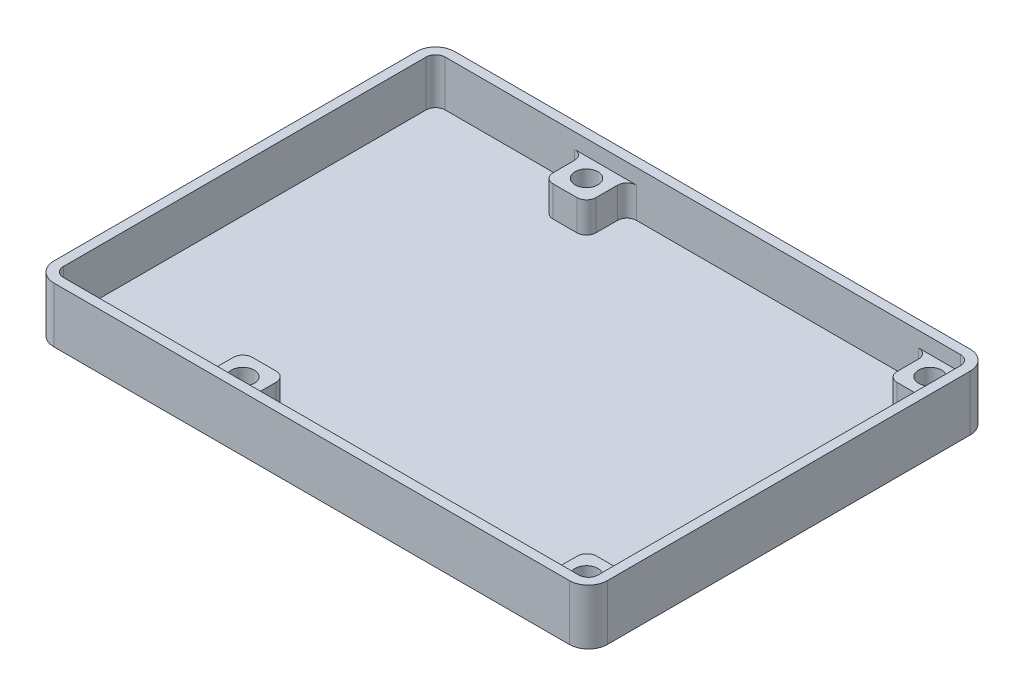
ISO-10303-21;
HEADER;
FILE_DESCRIPTION(('STEP AP214'),'2;1');
FILE_NAME('part.step','',(''),(''),'','','');
FILE_SCHEMA(('AUTOMOTIVE_DESIGN { 1 0 10303 214 1 1 1 1 }'));
ENDSEC;
DATA;
#1=APPLICATION_CONTEXT('core data for automotive mechanical design processes');
#2=APPLICATION_PROTOCOL_DEFINITION('international standard','automotive_design',2000,#1);
#3=PRODUCT_CONTEXT('',#1,'mechanical');
#4=PRODUCT('Part','Part','',(#3));
#5=PRODUCT_RELATED_PRODUCT_CATEGORY('part','',(#4));
#6=PRODUCT_DEFINITION_FORMATION('','',#4);
#7=PRODUCT_DEFINITION_CONTEXT('part definition',#1,'design');
#8=PRODUCT_DEFINITION('design','',#6,#7);
#9=PRODUCT_DEFINITION_SHAPE('','',#8);
#10=(LENGTH_UNIT() NAMED_UNIT(*) SI_UNIT(.MILLI.,.METRE.));
#11=(NAMED_UNIT(*) PLANE_ANGLE_UNIT() SI_UNIT($,.RADIAN.));
#12=(NAMED_UNIT(*) SI_UNIT($,.STERADIAN.) SOLID_ANGLE_UNIT());
#13=UNCERTAINTY_MEASURE_WITH_UNIT(LENGTH_MEASURE(1.E-05),#10,'distance_accuracy_value','');
#14=(GEOMETRIC_REPRESENTATION_CONTEXT(3) GLOBAL_UNCERTAINTY_ASSIGNED_CONTEXT((#13)) GLOBAL_UNIT_ASSIGNED_CONTEXT((#10,
#11,#12)) REPRESENTATION_CONTEXT('',''));
#15=CARTESIAN_POINT('',(0.,0.,0.));
#16=DIRECTION('',(0.,0.,1.));
#17=DIRECTION('',(1.,0.,0.));
#18=AXIS2_PLACEMENT_3D('',#15,#16,#17);
#19=CARTESIAN_POINT('',(0.,1.,0.));
#20=DIRECTION('',(0.,1.,0.));
#21=DIRECTION('',(0.,0.,1.));
#22=AXIS2_PLACEMENT_3D('',#19,#20,#21);
#23=PLANE('',#22);
#24=DIRECTION('',(1.,0.,0.));
#25=VECTOR('',#24,1.);
#26=CARTESIAN_POINT('',(-28.,1.,20.));
#27=LINE('',#26,#25);
#28=CARTESIAN_POINT('',(-27.,1.,20.));
#29=VERTEX_POINT('',#28);
#30=CARTESIAN_POINT('',(-13.4499999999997,1.,20.));
#31=VERTEX_POINT('',#30);
#32=EDGE_CURVE('E591',#29,#31,#27,.T.);
#33=ORIENTED_EDGE('',*,*,#32,.T.);
#34=CARTESIAN_POINT('',(-13.4499999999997,1.,19.));
#35=DIRECTION('',(0.,1.,0.));
#36=DIRECTION('',(0.,0.,1.));
#37=AXIS2_PLACEMENT_3D('',#34,#35,#36);
#38=CIRCLE('',#37,1.);
#39=CARTESIAN_POINT('',(-12.4499999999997,1.,19.));
#40=VERTEX_POINT('',#39);
#41=EDGE_CURVE('E384',#31,#40,#38,.T.);
#42=ORIENTED_EDGE('',*,*,#41,.T.);
#43=DIRECTION('',(0.,0.,1.));
#44=VECTOR('',#43,1.);
#45=CARTESIAN_POINT('',(-12.4499999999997,1.,20.2499999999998));
#46=LINE('',#45,#44);
#47=CARTESIAN_POINT('',(-12.4499999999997,1.,16.7499999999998));
#48=VERTEX_POINT('',#47);
#49=EDGE_CURVE('E783',#48,#40,#46,.T.);
#50=ORIENTED_EDGE('',*,*,#49,.F.);
#51=CARTESIAN_POINT('',(-11.4499999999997,1.,16.7499999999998));
#52=DIRECTION('',(0.,1.,0.));
#53=DIRECTION('',(0.,0.,1.));
#54=AXIS2_PLACEMENT_3D('',#51,#52,#53);
#55=CIRCLE('',#54,1.);
#56=CARTESIAN_POINT('',(-11.4499999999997,1.,15.7499999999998));
#57=VERTEX_POINT('',#56);
#58=EDGE_CURVE('E462',#48,#57,#55,.F.);
#59=ORIENTED_EDGE('',*,*,#58,.T.);
#60=DIRECTION('',(-1.,0.,0.));
#61=VECTOR('',#60,1.);
#62=CARTESIAN_POINT('',(-12.4499999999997,1.,15.7499999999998));
#63=LINE('',#62,#61);
#64=CARTESIAN_POINT('',(-8.94999999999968,1.,15.7499999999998));
#65=VERTEX_POINT('',#64);
#66=EDGE_CURVE('E885',#65,#57,#63,.T.);
#67=ORIENTED_EDGE('',*,*,#66,.F.);
#68=CARTESIAN_POINT('',(-8.94999999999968,1.,16.7499999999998));
#69=DIRECTION('',(0.,1.,0.));
#70=DIRECTION('',(0.,0.,1.));
#71=AXIS2_PLACEMENT_3D('',#68,#69,#70);
#72=CIRCLE('',#71,1.);
#73=CARTESIAN_POINT('',(-7.94999999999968,1.,16.7499999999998));
#74=VERTEX_POINT('',#73);
#75=EDGE_CURVE('E464',#65,#74,#72,.F.);
#76=ORIENTED_EDGE('',*,*,#75,.T.);
#77=DIRECTION('',(0.,0.,-1.));
#78=VECTOR('',#77,1.);
#79=CARTESIAN_POINT('',(-7.94999999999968,1.,20.2499999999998));
#80=LINE('',#79,#78);
#81=CARTESIAN_POINT('',(-7.94999999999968,1.,19.));
#82=VERTEX_POINT('',#81);
#83=EDGE_CURVE('E883',#82,#74,#80,.T.);
#84=ORIENTED_EDGE('',*,*,#83,.F.);
#85=CARTESIAN_POINT('',(-6.94999999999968,1.,19.));
#86=DIRECTION('',(0.,1.,0.));
#87=DIRECTION('',(0.,0.,1.));
#88=AXIS2_PLACEMENT_3D('',#85,#86,#87);
#89=CIRCLE('',#88,1.);
#90=CARTESIAN_POINT('',(-6.94999999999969,1.,20.));
#91=VERTEX_POINT('',#90);
#92=EDGE_CURVE('E382',#82,#91,#89,.T.);
#93=ORIENTED_EDGE('',*,*,#92,.T.);
#94=CARTESIAN_POINT('',(22.6000000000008,1.,20.));
#95=VERTEX_POINT('',#94);
#96=EDGE_CURVE('E590',#91,#95,#27,.T.);
#97=ORIENTED_EDGE('',*,*,#96,.T.);
#98=CARTESIAN_POINT('',(22.6000000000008,1.,19.));
#99=DIRECTION('',(0.,1.,0.));
#100=DIRECTION('',(0.,0.,1.));
#101=AXIS2_PLACEMENT_3D('',#98,#99,#100);
#102=CIRCLE('',#101,1.);
#103=CARTESIAN_POINT('',(23.6000000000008,1.,19.));
#104=VERTEX_POINT('',#103);
#105=EDGE_CURVE('E376',#95,#104,#102,.T.);
#106=ORIENTED_EDGE('',*,*,#105,.T.);
#107=DIRECTION('',(0.,0.,1.));
#108=VECTOR('',#107,1.);
#109=CARTESIAN_POINT('',(23.6000000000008,1.,20.2499999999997));
#110=LINE('',#109,#108);
#111=CARTESIAN_POINT('',(23.6000000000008,1.,16.7499999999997));
#112=VERTEX_POINT('',#111);
#113=EDGE_CURVE('E792',#112,#104,#110,.T.);
#114=ORIENTED_EDGE('',*,*,#113,.F.);
#115=CARTESIAN_POINT('',(24.6000000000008,1.,16.7499999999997));
#116=DIRECTION('',(0.,1.,0.));
#117=DIRECTION('',(0.,0.,1.));
#118=AXIS2_PLACEMENT_3D('',#115,#116,#117);
#119=CIRCLE('',#118,1.);
#120=CARTESIAN_POINT('',(24.6000000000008,1.,15.7499999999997));
#121=VERTEX_POINT('',#120);
#122=EDGE_CURVE('E477',#112,#121,#119,.F.);
#123=ORIENTED_EDGE('',*,*,#122,.T.);
#124=DIRECTION('',(-1.,0.,0.));
#125=VECTOR('',#124,1.);
#126=CARTESIAN_POINT('',(23.6000000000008,1.,15.7499999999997));
#127=LINE('',#126,#125);
#128=CARTESIAN_POINT('',(27.,1.,15.7499999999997));
#129=VERTEX_POINT('',#128);
#130=EDGE_CURVE('E343',#129,#121,#127,.T.);
#131=ORIENTED_EDGE('',*,*,#130,.F.);
#132=CARTESIAN_POINT('',(27.,1.,14.7499999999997));
#133=DIRECTION('',(0.,1.,0.));
#134=DIRECTION('',(0.,0.,1.));
#135=AXIS2_PLACEMENT_3D('',#132,#133,#134);
#136=CIRCLE('',#135,1.);
#137=CARTESIAN_POINT('',(28.,1.,14.7499999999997));
#138=VERTEX_POINT('',#137);
#139=EDGE_CURVE('E374',#129,#138,#136,.T.);
#140=ORIENTED_EDGE('',*,*,#139,.T.);
#141=DIRECTION('',(0.,0.,-1.));
#142=VECTOR('',#141,1.);
#143=CARTESIAN_POINT('',(28.,1.,-20.));
#144=LINE('',#143,#142);
#145=CARTESIAN_POINT('',(28.,1.,-14.7500000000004));
#146=VERTEX_POINT('',#145);
#147=EDGE_CURVE('E580',#138,#146,#144,.T.);
#148=ORIENTED_EDGE('',*,*,#147,.T.);
#149=CARTESIAN_POINT('',(27.,1.,-14.7500000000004));
#150=DIRECTION('',(0.,1.,0.));
#151=DIRECTION('',(0.,0.,1.));
#152=AXIS2_PLACEMENT_3D('',#149,#150,#151);
#153=CIRCLE('',#152,1.);
#154=CARTESIAN_POINT('',(27.,1.,-15.7500000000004));
#155=VERTEX_POINT('',#154);
#156=EDGE_CURVE('E372',#146,#155,#153,.T.);
#157=ORIENTED_EDGE('',*,*,#156,.T.);
#158=DIRECTION('',(1.,0.,0.));
#159=VECTOR('',#158,1.);
#160=CARTESIAN_POINT('',(23.6000000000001,1.,-15.7500000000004));
#161=LINE('',#160,#159);
#162=CARTESIAN_POINT('',(24.6000000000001,1.,-15.7500000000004));
#163=VERTEX_POINT('',#162);
#164=EDGE_CURVE('E809',#163,#155,#161,.T.);
#165=ORIENTED_EDGE('',*,*,#164,.F.);
#166=CARTESIAN_POINT('',(24.6000000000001,1.,-16.7500000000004));
#167=DIRECTION('',(0.,1.,0.));
#168=DIRECTION('',(0.,0.,1.));
#169=AXIS2_PLACEMENT_3D('',#166,#167,#168);
#170=CIRCLE('',#169,1.);
#171=CARTESIAN_POINT('',(23.6000000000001,1.,-16.7500000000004));
#172=VERTEX_POINT('',#171);
#173=EDGE_CURVE('E484',#163,#172,#170,.F.);
#174=ORIENTED_EDGE('',*,*,#173,.T.);
#175=DIRECTION('',(0.,0.,1.));
#176=VECTOR('',#175,1.);
#177=CARTESIAN_POINT('',(23.6000000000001,1.,-20.2500000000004));
#178=LINE('',#177,#176);
#179=CARTESIAN_POINT('',(23.6000000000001,1.,-19.));
#180=VERTEX_POINT('',#179);
#181=EDGE_CURVE('E807',#180,#172,#178,.T.);
#182=ORIENTED_EDGE('',*,*,#181,.F.);
#183=CARTESIAN_POINT('',(22.6000000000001,1.,-19.));
#184=DIRECTION('',(0.,1.,0.));
#185=DIRECTION('',(0.,0.,1.));
#186=AXIS2_PLACEMENT_3D('',#183,#184,#185);
#187=CIRCLE('',#186,1.);
#188=CARTESIAN_POINT('',(22.6000000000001,1.,-20.));
#189=VERTEX_POINT('',#188);
#190=EDGE_CURVE('E370',#180,#189,#187,.T.);
#191=ORIENTED_EDGE('',*,*,#190,.T.);
#192=DIRECTION('',(-1.,0.,0.));
#193=VECTOR('',#192,1.);
#194=CARTESIAN_POINT('',(-28.,1.,-20.));
#195=LINE('',#194,#193);
#196=CARTESIAN_POINT('',(-6.95,1.,-20.));
#197=VERTEX_POINT('',#196);
#198=EDGE_CURVE('E584',#189,#197,#195,.T.);
#199=ORIENTED_EDGE('',*,*,#198,.T.);
#200=CARTESIAN_POINT('',(-6.95,1.,-19.));
#201=DIRECTION('',(0.,1.,0.));
#202=DIRECTION('',(0.,0.,1.));
#203=AXIS2_PLACEMENT_3D('',#200,#201,#202);
#204=CIRCLE('',#203,1.);
#205=CARTESIAN_POINT('',(-7.95,1.,-19.));
#206=VERTEX_POINT('',#205);
#207=EDGE_CURVE('E378',#197,#206,#204,.T.);
#208=ORIENTED_EDGE('',*,*,#207,.T.);
#209=DIRECTION('',(0.,0.,-1.));
#210=VECTOR('',#209,1.);
#211=CARTESIAN_POINT('',(-7.95,1.,-20.25));
#212=LINE('',#211,#210);
#213=CARTESIAN_POINT('',(-7.94999999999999,1.,-16.75));
#214=VERTEX_POINT('',#213);
#215=EDGE_CURVE('E1023',#214,#206,#212,.T.);
#216=ORIENTED_EDGE('',*,*,#215,.F.);
#217=CARTESIAN_POINT('',(-8.94999999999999,1.,-16.75));
#218=DIRECTION('',(0.,1.,0.));
#219=DIRECTION('',(0.,0.,1.));
#220=AXIS2_PLACEMENT_3D('',#217,#218,#219);
#221=CIRCLE('',#220,1.);
#222=CARTESIAN_POINT('',(-8.94999999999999,1.,-15.75));
#223=VERTEX_POINT('',#222);
#224=EDGE_CURVE('E470',#214,#223,#221,.F.);
#225=ORIENTED_EDGE('',*,*,#224,.T.);
#226=DIRECTION('',(1.,0.,0.));
#227=VECTOR('',#226,1.);
#228=CARTESIAN_POINT('',(-12.45,1.,-15.75));
#229=LINE('',#228,#227);
#230=CARTESIAN_POINT('',(-11.45,1.,-15.75));
#231=VERTEX_POINT('',#230);
#232=EDGE_CURVE('E773',#231,#223,#229,.T.);
#233=ORIENTED_EDGE('',*,*,#232,.F.);
#234=CARTESIAN_POINT('',(-11.45,1.,-16.75));
#235=DIRECTION('',(0.,1.,0.));
#236=DIRECTION('',(0.,0.,1.));
#237=AXIS2_PLACEMENT_3D('',#234,#235,#236);
#238=CIRCLE('',#237,1.);
#239=CARTESIAN_POINT('',(-12.45,1.,-16.75));
#240=VERTEX_POINT('',#239);
#241=EDGE_CURVE('E468',#231,#240,#238,.F.);
#242=ORIENTED_EDGE('',*,*,#241,.T.);
#243=DIRECTION('',(0.,0.,1.));
#244=VECTOR('',#243,1.);
#245=CARTESIAN_POINT('',(-12.45,1.,-20.25));
#246=LINE('',#245,#244);
#247=CARTESIAN_POINT('',(-12.45,1.,-19.));
#248=VERTEX_POINT('',#247);
#249=EDGE_CURVE('E779',#248,#240,#246,.T.);
#250=ORIENTED_EDGE('',*,*,#249,.F.);
#251=CARTESIAN_POINT('',(-13.45,1.,-19.));
#252=DIRECTION('',(0.,1.,0.));
#253=DIRECTION('',(0.,0.,1.));
#254=AXIS2_PLACEMENT_3D('',#251,#252,#253);
#255=CIRCLE('',#254,1.);
#256=CARTESIAN_POINT('',(-13.45,1.,-20.));
#257=VERTEX_POINT('',#256);
#258=EDGE_CURVE('E380',#248,#257,#255,.T.);
#259=ORIENTED_EDGE('',*,*,#258,.T.);
#260=CARTESIAN_POINT('',(-27.,1.,-20.));
#261=VERTEX_POINT('',#260);
#262=EDGE_CURVE('E583',#257,#261,#195,.T.);
#263=ORIENTED_EDGE('',*,*,#262,.T.);
#264=CARTESIAN_POINT('',(-27.,1.,-19.));
#265=DIRECTION('',(0.,1.,0.));
#266=DIRECTION('',(0.,0.,1.));
#267=AXIS2_PLACEMENT_3D('',#264,#265,#266);
#268=CIRCLE('',#267,1.);
#269=CARTESIAN_POINT('',(-28.,1.,-19.));
#270=VERTEX_POINT('',#269);
#271=EDGE_CURVE('E594',#261,#270,#268,.T.);
#272=ORIENTED_EDGE('',*,*,#271,.T.);
#273=DIRECTION('',(0.,0.,1.));
#274=VECTOR('',#273,1.);
#275=CARTESIAN_POINT('',(-28.,1.,-20.));
#276=LINE('',#275,#274);
#277=CARTESIAN_POINT('',(-28.,1.,19.));
#278=VERTEX_POINT('',#277);
#279=EDGE_CURVE('E587',#270,#278,#276,.T.);
#280=ORIENTED_EDGE('',*,*,#279,.T.);
#281=CARTESIAN_POINT('',(-27.,1.,19.));
#282=DIRECTION('',(0.,1.,0.));
#283=DIRECTION('',(0.,0.,1.));
#284=AXIS2_PLACEMENT_3D('',#281,#282,#283);
#285=CIRCLE('',#284,1.);
#286=EDGE_CURVE('E356',#278,#29,#285,.T.);
#287=ORIENTED_EDGE('',*,*,#286,.T.);
#288=EDGE_LOOP('',(#33,#42,#50,#59,#67,#76,#84,#93,#97,#106,#114,#123,#131,#140,#148,#157,#165,
#174,#182,#191,#199,#208,#216,#225,#233,#242,#250,#259,#263,#272,#280,#287));
#289=FACE_BOUND('',#288,.T.);
#290=ADVANCED_FACE('F39',(#289),#23,.T.);
#291=CARTESIAN_POINT('',(27.,5.8,-20.));
#292=DIRECTION('',(0.,0.,1.));
#293=DIRECTION('',(1.,0.,0.));
#294=AXIS2_PLACEMENT_3D('',#291,#292,#293);
#295=PLANE('',#294);
#296=ORIENTED_EDGE('',*,*,#262,.F.);
#297=DIRECTION('',(0.,1.,0.));
#298=VECTOR('',#297,1.);
#299=CARTESIAN_POINT('',(-13.45,5.8,-20.));
#300=LINE('',#299,#298);
#301=CARTESIAN_POINT('',(-13.45,4.2,-20.));
#302=VERTEX_POINT('',#301);
#303=EDGE_CURVE('E410',#257,#302,#300,.T.);
#304=ORIENTED_EDGE('',*,*,#303,.T.);
#305=DIRECTION('',(-1.,0.,0.));
#306=VECTOR('',#305,1.);
#307=CARTESIAN_POINT('',(27.,4.2,-20.));
#308=LINE('',#307,#306);
#309=CARTESIAN_POINT('',(-6.95,4.2,-20.));
#310=VERTEX_POINT('',#309);
#311=EDGE_CURVE('E354',#310,#302,#308,.T.);
#312=ORIENTED_EDGE('',*,*,#311,.F.);
#313=DIRECTION('',(0.,-1.,0.));
#314=VECTOR('',#313,1.);
#315=CARTESIAN_POINT('',(-6.95,5.8,-20.));
#316=LINE('',#315,#314);
#317=EDGE_CURVE('E407',#310,#197,#316,.T.);
#318=ORIENTED_EDGE('',*,*,#317,.T.);
#319=ORIENTED_EDGE('',*,*,#198,.F.);
#320=DIRECTION('',(0.,1.,0.));
#321=VECTOR('',#320,1.);
#322=CARTESIAN_POINT('',(22.6000000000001,5.8,-20.));
#323=LINE('',#322,#321);
#324=CARTESIAN_POINT('',(22.6000000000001,4.2,-20.));
#325=VERTEX_POINT('',#324);
#326=EDGE_CURVE('E404',#189,#325,#323,.T.);
#327=ORIENTED_EDGE('',*,*,#326,.T.);
#328=DIRECTION('',(-1.,0.,0.));
#329=VECTOR('',#328,1.);
#330=CARTESIAN_POINT('',(27.,4.2,-20.));
#331=LINE('',#330,#329);
#332=CARTESIAN_POINT('',(27.,4.2,-20.));
#333=VERTEX_POINT('',#332);
#334=EDGE_CURVE('E352',#333,#325,#331,.T.);
#335=ORIENTED_EDGE('',*,*,#334,.F.);
#336=DIRECTION('',(0.,-1.,0.));
#337=VECTOR('',#336,1.);
#338=CARTESIAN_POINT('',(27.,5.8,-20.));
#339=LINE('',#338,#337);
#340=CARTESIAN_POINT('',(27.,5.8,-20.));
#341=VERTEX_POINT('',#340);
#342=EDGE_CURVE('E835',#341,#333,#339,.T.);
#343=ORIENTED_EDGE('',*,*,#342,.F.);
#344=DIRECTION('',(-1.,0.,0.));
#345=VECTOR('',#344,1.);
#346=CARTESIAN_POINT('',(27.,5.8,-20.));
#347=LINE('',#346,#345);
#348=CARTESIAN_POINT('',(-27.,5.8,-20.));
#349=VERTEX_POINT('',#348);
#350=EDGE_CURVE('E830',#341,#349,#347,.T.);
#351=ORIENTED_EDGE('',*,*,#350,.T.);
#352=DIRECTION('',(0.,-1.,0.));
#353=VECTOR('',#352,1.);
#354=CARTESIAN_POINT('',(-27.,5.8,-20.));
#355=LINE('',#354,#353);
#356=EDGE_CURVE('E832',#349,#261,#355,.T.);
#357=ORIENTED_EDGE('',*,*,#356,.T.);
#358=EDGE_LOOP('',(#296,#304,#312,#318,#319,#327,#335,#343,#351,#357));
#359=FACE_BOUND('',#358,.T.);
#360=ADVANCED_FACE('F672',(#359),#295,.T.);
#361=CARTESIAN_POINT('',(-27.,5.8,20.));
#362=DIRECTION('',(0.,0.,-1.));
#363=DIRECTION('',(-1.,0.,0.));
#364=AXIS2_PLACEMENT_3D('',#361,#362,#363);
#365=PLANE('',#364);
#366=DIRECTION('',(1.,0.,0.));
#367=VECTOR('',#366,1.);
#368=CARTESIAN_POINT('',(-27.,4.2,20.));
#369=LINE('',#368,#367);
#370=CARTESIAN_POINT('',(-13.4499999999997,4.2,20.));
#371=VERTEX_POINT('',#370);
#372=CARTESIAN_POINT('',(-6.94999999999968,4.2,20.));
#373=VERTEX_POINT('',#372);
#374=EDGE_CURVE('E351',#371,#373,#369,.T.);
#375=ORIENTED_EDGE('',*,*,#374,.F.);
#376=DIRECTION('',(0.,-1.,0.));
#377=VECTOR('',#376,1.);
#378=CARTESIAN_POINT('',(-13.4499999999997,5.8,20.));
#379=LINE('',#378,#377);
#380=EDGE_CURVE('E367',#371,#31,#379,.T.);
#381=ORIENTED_EDGE('',*,*,#380,.T.);
#382=ORIENTED_EDGE('',*,*,#32,.F.);
#383=DIRECTION('',(0.,-1.,0.));
#384=VECTOR('',#383,1.);
#385=CARTESIAN_POINT('',(-27.,5.8,20.));
#386=LINE('',#385,#384);
#387=CARTESIAN_POINT('',(-27.,5.8,20.));
#388=VERTEX_POINT('',#387);
#389=EDGE_CURVE('E605',#388,#29,#386,.T.);
#390=ORIENTED_EDGE('',*,*,#389,.F.);
#391=DIRECTION('',(1.,0.,0.));
#392=VECTOR('',#391,1.);
#393=CARTESIAN_POINT('',(-27.,5.8,20.));
#394=LINE('',#393,#392);
#395=CARTESIAN_POINT('',(27.,5.8,20.));
#396=VERTEX_POINT('',#395);
#397=EDGE_CURVE('E822',#388,#396,#394,.T.);
#398=ORIENTED_EDGE('',*,*,#397,.T.);
#399=DIRECTION('',(0.,-1.,0.));
#400=VECTOR('',#399,1.);
#401=CARTESIAN_POINT('',(27.,5.8,20.));
#402=LINE('',#401,#400);
#403=CARTESIAN_POINT('',(27.,4.2,20.));
#404=VERTEX_POINT('',#403);
#405=EDGE_CURVE('E332',#396,#404,#402,.T.);
#406=ORIENTED_EDGE('',*,*,#405,.T.);
#407=DIRECTION('',(1.,0.,0.));
#408=VECTOR('',#407,1.);
#409=CARTESIAN_POINT('',(-27.,4.2,20.));
#410=LINE('',#409,#408);
#411=CARTESIAN_POINT('',(22.6000000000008,4.2,20.));
#412=VERTEX_POINT('',#411);
#413=EDGE_CURVE('E350',#412,#404,#410,.T.);
#414=ORIENTED_EDGE('',*,*,#413,.F.);
#415=DIRECTION('',(0.,-1.,0.));
#416=VECTOR('',#415,1.);
#417=CARTESIAN_POINT('',(22.6000000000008,5.8,20.));
#418=LINE('',#417,#416);
#419=EDGE_CURVE('E361',#412,#95,#418,.T.);
#420=ORIENTED_EDGE('',*,*,#419,.T.);
#421=ORIENTED_EDGE('',*,*,#96,.F.);
#422=DIRECTION('',(0.,1.,0.));
#423=VECTOR('',#422,1.);
#424=CARTESIAN_POINT('',(-6.94999999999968,5.8,20.));
#425=LINE('',#424,#423);
#426=EDGE_CURVE('E364',#91,#373,#425,.T.);
#427=ORIENTED_EDGE('',*,*,#426,.T.);
#428=EDGE_LOOP('',(#375,#381,#382,#390,#398,#406,#414,#420,#421,#427));
#429=FACE_BOUND('',#428,.T.);
#430=ADVANCED_FACE('F677',(#429),#365,.T.);
#431=CARTESIAN_POINT('',(28.,5.8,19.));
#432=DIRECTION('',(-1.,0.,0.));
#433=DIRECTION('',(0.,0.,1.));
#434=AXIS2_PLACEMENT_3D('',#431,#432,#433);
#435=PLANE('',#434);
#436=ORIENTED_EDGE('',*,*,#147,.F.);
#437=DIRECTION('',(0.,-1.,0.));
#438=VECTOR('',#437,1.);
#439=CARTESIAN_POINT('',(28.,5.8,14.7499999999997));
#440=LINE('',#439,#438);
#441=CARTESIAN_POINT('',(28.,4.2,14.7499999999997));
#442=VERTEX_POINT('',#441);
#443=EDGE_CURVE('E340',#138,#442,#440,.F.);
#444=ORIENTED_EDGE('',*,*,#443,.T.);
#445=DIRECTION('',(0.,0.,-1.));
#446=VECTOR('',#445,1.);
#447=CARTESIAN_POINT('',(28.,4.2,20.2499999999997));
#448=LINE('',#447,#446);
#449=CARTESIAN_POINT('',(28.,4.2,19.));
#450=VERTEX_POINT('',#449);
#451=EDGE_CURVE('E336',#450,#442,#448,.T.);
#452=ORIENTED_EDGE('',*,*,#451,.F.);
#453=DIRECTION('',(0.,-1.,0.));
#454=VECTOR('',#453,1.);
#455=CARTESIAN_POINT('',(28.,5.8,19.));
#456=LINE('',#455,#454);
#457=CARTESIAN_POINT('',(28.,5.8,19.));
#458=VERTEX_POINT('',#457);
#459=EDGE_CURVE('E321',#458,#450,#456,.T.);
#460=ORIENTED_EDGE('',*,*,#459,.F.);
#461=DIRECTION('',(0.,0.,-1.));
#462=VECTOR('',#461,1.);
#463=CARTESIAN_POINT('',(28.,5.8,19.));
#464=LINE('',#463,#462);
#465=CARTESIAN_POINT('',(28.,5.8,-19.));
#466=VERTEX_POINT('',#465);
#467=EDGE_CURVE('E825',#458,#466,#464,.T.);
#468=ORIENTED_EDGE('',*,*,#467,.T.);
#469=DIRECTION('',(0.,-1.,0.));
#470=VECTOR('',#469,1.);
#471=CARTESIAN_POINT('',(28.,5.8,-19.));
#472=LINE('',#471,#470);
#473=CARTESIAN_POINT('',(28.,4.2,-19.));
#474=VERTEX_POINT('',#473);
#475=EDGE_CURVE('E333',#466,#474,#472,.T.);
#476=ORIENTED_EDGE('',*,*,#475,.T.);
#477=DIRECTION('',(0.,0.,-1.));
#478=VECTOR('',#477,1.);
#479=CARTESIAN_POINT('',(28.,4.2,-20.2500000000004));
#480=LINE('',#479,#478);
#481=CARTESIAN_POINT('',(28.,4.2,-14.7500000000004));
#482=VERTEX_POINT('',#481);
#483=EDGE_CURVE('E804',#482,#474,#480,.T.);
#484=ORIENTED_EDGE('',*,*,#483,.F.);
#485=DIRECTION('',(0.,-1.,0.));
#486=VECTOR('',#485,1.);
#487=CARTESIAN_POINT('',(28.,5.8,-14.7500000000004));
#488=LINE('',#487,#486);
#489=EDGE_CURVE('E443',#482,#146,#488,.T.);
#490=ORIENTED_EDGE('',*,*,#489,.T.);
#491=EDGE_LOOP('',(#436,#444,#452,#460,#468,#476,#484,#490));
#492=FACE_BOUND('',#491,.T.);
#493=ADVANCED_FACE('F338',(#492),#435,.T.);
#494=CARTESIAN_POINT('',(0.,0.,0.));
#495=DIRECTION('',(0.,1.,0.));
#496=DIRECTION('',(0.,0.,1.));
#497=AXIS2_PLACEMENT_3D('',#494,#495,#496);
#498=PLANE('',#497);
#499=CARTESIAN_POINT('',(25.8000000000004,0.,17.9999999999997));
#500=DIRECTION('',(0.,1.,0.));
#501=DIRECTION('',(0.,0.,1.));
#502=AXIS2_PLACEMENT_3D('',#499,#500,#501);
#503=CIRCLE('',#502,2.20000000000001);
#504=CARTESIAN_POINT('',(25.8000000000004,0.,20.1999999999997));
#505=VERTEX_POINT('',#504);
#506=EDGE_CURVE('E496',#505,#505,#503,.T.);
#507=ORIENTED_EDGE('',*,*,#506,.T.);
#508=EDGE_LOOP('',(#507));
#509=FACE_BOUND('',#508,.T.);
#510=CARTESIAN_POINT('',(-10.1999999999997,0.,17.9999999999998));
#511=DIRECTION('',(0.,1.,0.));
#512=DIRECTION('',(0.,0.,1.));
#513=AXIS2_PLACEMENT_3D('',#510,#511,#512);
#514=CIRCLE('',#513,2.20000000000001);
#515=CARTESIAN_POINT('',(-10.1999999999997,0.,20.1999999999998));
#516=VERTEX_POINT('',#515);
#517=EDGE_CURVE('E493',#516,#516,#514,.T.);
#518=ORIENTED_EDGE('',*,*,#517,.T.);
#519=EDGE_LOOP('',(#518));
#520=FACE_BOUND('',#519,.T.);
#521=CARTESIAN_POINT('',(25.8000000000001,0.,-18.0000000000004));
#522=DIRECTION('',(0.,1.,0.));
#523=DIRECTION('',(0.,0.,1.));
#524=AXIS2_PLACEMENT_3D('',#521,#522,#523);
#525=CIRCLE('',#524,2.19999999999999);
#526=CARTESIAN_POINT('',(25.8000000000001,0.,-15.8000000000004));
#527=VERTEX_POINT('',#526);
#528=EDGE_CURVE('E490',#527,#527,#525,.T.);
#529=ORIENTED_EDGE('',*,*,#528,.T.);
#530=EDGE_LOOP('',(#529));
#531=FACE_BOUND('',#530,.T.);
#532=CARTESIAN_POINT('',(-10.2,0.,-18.));
#533=DIRECTION('',(0.,1.,0.));
#534=DIRECTION('',(0.,0.,1.));
#535=AXIS2_PLACEMENT_3D('',#532,#533,#534);
#536=CIRCLE('',#535,2.20000000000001);
#537=CARTESIAN_POINT('',(-10.2,0.,-15.8));
#538=VERTEX_POINT('',#537);
#539=EDGE_CURVE('E487',#538,#538,#536,.T.);
#540=ORIENTED_EDGE('',*,*,#539,.T.);
#541=EDGE_LOOP('',(#540));
#542=FACE_BOUND('',#541,.T.);
#543=CARTESIAN_POINT('',(-27.,0.,-19.));
#544=DIRECTION('',(0.,1.,0.));
#545=DIRECTION('',(0.,0.,1.));
#546=AXIS2_PLACEMENT_3D('',#543,#544,#545);
#547=CIRCLE('',#546,2.);
#548=CARTESIAN_POINT('',(-27.,0.,-21.));
#549=VERTEX_POINT('',#548);
#550=CARTESIAN_POINT('',(-29.,0.,-19.));
#551=VERTEX_POINT('',#550);
#552=EDGE_CURVE('E527',#549,#551,#547,.T.);
#553=ORIENTED_EDGE('',*,*,#552,.F.);
#554=DIRECTION('',(-1.,0.,0.));
#555=VECTOR('',#554,1.);
#556=CARTESIAN_POINT('',(27.,0.,-21.));
#557=LINE('',#556,#555);
#558=CARTESIAN_POINT('',(27.,0.,-21.));
#559=VERTEX_POINT('',#558);
#560=EDGE_CURVE('E529',#559,#549,#557,.T.);
#561=ORIENTED_EDGE('',*,*,#560,.F.);
#562=CARTESIAN_POINT('',(27.,0.,-19.));
#563=DIRECTION('',(0.,1.,0.));
#564=DIRECTION('',(0.,0.,1.));
#565=AXIS2_PLACEMENT_3D('',#562,#563,#564);
#566=CIRCLE('',#565,2.);
#567=CARTESIAN_POINT('',(29.,0.,-19.));
#568=VERTEX_POINT('',#567);
#569=EDGE_CURVE('E554',#568,#559,#566,.T.);
#570=ORIENTED_EDGE('',*,*,#569,.F.);
#571=DIRECTION('',(0.,0.,-1.));
#572=VECTOR('',#571,1.);
#573=CARTESIAN_POINT('',(29.,0.,19.));
#574=LINE('',#573,#572);
#575=CARTESIAN_POINT('',(29.,0.,19.));
#576=VERTEX_POINT('',#575);
#577=EDGE_CURVE('E552',#576,#568,#574,.T.);
#578=ORIENTED_EDGE('',*,*,#577,.F.);
#579=CARTESIAN_POINT('',(27.,0.,19.));
#580=DIRECTION('',(0.,1.,0.));
#581=DIRECTION('',(0.,0.,1.));
#582=AXIS2_PLACEMENT_3D('',#579,#580,#581);
#583=CIRCLE('',#582,2.);
#584=CARTESIAN_POINT('',(27.,0.,21.));
#585=VERTEX_POINT('',#584);
#586=EDGE_CURVE('E550',#585,#576,#583,.T.);
#587=ORIENTED_EDGE('',*,*,#586,.F.);
#588=DIRECTION('',(1.,0.,0.));
#589=VECTOR('',#588,1.);
#590=CARTESIAN_POINT('',(-27.,0.,21.));
#591=LINE('',#590,#589);
#592=CARTESIAN_POINT('',(-27.,0.,21.));
#593=VERTEX_POINT('',#592);
#594=EDGE_CURVE('E548',#593,#585,#591,.T.);
#595=ORIENTED_EDGE('',*,*,#594,.F.);
#596=CARTESIAN_POINT('',(-27.,0.,19.));
#597=DIRECTION('',(0.,1.,0.));
#598=DIRECTION('',(0.,0.,1.));
#599=AXIS2_PLACEMENT_3D('',#596,#597,#598);
#600=CIRCLE('',#599,2.);
#601=CARTESIAN_POINT('',(-29.,0.,19.));
#602=VERTEX_POINT('',#601);
#603=EDGE_CURVE('E538',#602,#593,#600,.T.);
#604=ORIENTED_EDGE('',*,*,#603,.F.);
#605=DIRECTION('',(0.,0.,1.));
#606=VECTOR('',#605,1.);
#607=CARTESIAN_POINT('',(-29.,0.,-19.));
#608=LINE('',#607,#606);
#609=EDGE_CURVE('E531',#551,#602,#608,.T.);
#610=ORIENTED_EDGE('',*,*,#609,.F.);
#611=EDGE_LOOP('',(#553,#561,#570,#578,#587,#595,#604,#610));
#612=FACE_BOUND('',#611,.T.);
#613=ADVANCED_FACE('F516',(#509,#520,#531,#542,#612),#498,.F.);
#614=CARTESIAN_POINT('',(-10.2,4.39411254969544,-18.));
#615=DIRECTION('',(0.,-1.,0.));
#616=DIRECTION('',(0.,0.,-1.));
#617=AXIS2_PLACEMENT_3D('',#614,#615,#616);
#618=CYLINDRICAL_SURFACE('',#617,1.2);
#619=CARTESIAN_POINT('',(-10.2,1.,-18.));
#620=DIRECTION('',(0.,1.,0.));
#621=DIRECTION('',(0.,0.,1.));
#622=AXIS2_PLACEMENT_3D('',#619,#620,#621);
#623=CIRCLE('',#622,1.2);
#624=CARTESIAN_POINT('',(-10.2,1.,-16.8));
#625=VERTEX_POINT('',#624);
#626=EDGE_CURVE('E12',#625,#625,#623,.F.);
#627=ORIENTED_EDGE('',*,*,#626,.T.);
#628=EDGE_LOOP('',(#627));
#629=FACE_BOUND('',#628,.T.);
#630=CARTESIAN_POINT('',(-10.2,4.2,-18.));
#631=DIRECTION('',(0.,1.,0.));
#632=DIRECTION('',(0.,0.,1.));
#633=AXIS2_PLACEMENT_3D('',#630,#631,#632);
#634=CIRCLE('',#633,1.2);
#635=CARTESIAN_POINT('',(-10.2,4.2,-16.8));
#636=VERTEX_POINT('',#635);
#637=EDGE_CURVE('E1013',#636,#636,#634,.T.);
#638=ORIENTED_EDGE('',*,*,#637,.T.);
#639=EDGE_LOOP('',(#638));
#640=FACE_BOUND('',#639,.T.);
#641=ADVANCED_FACE('F519',(#629,#640),#618,.F.);
#642=CARTESIAN_POINT('',(25.8000000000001,4.39411254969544,-18.0000000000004));
#643=DIRECTION('',(0.,-1.,0.));
#644=DIRECTION('',(0.,0.,-1.));
#645=AXIS2_PLACEMENT_3D('',#642,#643,#644);
#646=CYLINDRICAL_SURFACE('',#645,1.2);
#647=CARTESIAN_POINT('',(25.8000000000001,0.99999999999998,-18.0000000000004));
#648=DIRECTION('',(0.,1.,0.));
#649=DIRECTION('',(0.,0.,1.));
#650=AXIS2_PLACEMENT_3D('',#647,#648,#649);
#651=CIRCLE('',#650,1.2);
#652=CARTESIAN_POINT('',(25.8000000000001,0.99999999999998,-16.8000000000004));
#653=VERTEX_POINT('',#652);
#654=EDGE_CURVE('E48',#653,#653,#651,.F.);
#655=ORIENTED_EDGE('',*,*,#654,.T.);
#656=EDGE_LOOP('',(#655));
#657=FACE_BOUND('',#656,.T.);
#658=CARTESIAN_POINT('',(25.8000000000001,4.2,-18.0000000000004));
#659=DIRECTION('',(0.,1.,0.));
#660=DIRECTION('',(0.,0.,1.));
#661=AXIS2_PLACEMENT_3D('',#658,#659,#660);
#662=CIRCLE('',#661,1.2);
#663=CARTESIAN_POINT('',(25.8000000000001,4.2,-16.8000000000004));
#664=VERTEX_POINT('',#663);
#665=EDGE_CURVE('E798',#664,#664,#662,.T.);
#666=ORIENTED_EDGE('',*,*,#665,.T.);
#667=EDGE_LOOP('',(#666));
#668=FACE_BOUND('',#667,.T.);
#669=ADVANCED_FACE('F507',(#657,#668),#646,.F.);
#670=CARTESIAN_POINT('',(25.8000000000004,4.39411254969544,17.9999999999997));
#671=DIRECTION('',(0.,-1.,0.));
#672=DIRECTION('',(0.,0.,-1.));
#673=AXIS2_PLACEMENT_3D('',#670,#671,#672);
#674=CYLINDRICAL_SURFACE('',#673,1.2);
#675=CARTESIAN_POINT('',(25.8000000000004,1.,17.9999999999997));
#676=DIRECTION('',(0.,1.,0.));
#677=DIRECTION('',(0.,0.,1.));
#678=AXIS2_PLACEMENT_3D('',#675,#676,#677);
#679=CIRCLE('',#678,1.2);
#680=CARTESIAN_POINT('',(25.8000000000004,1.,19.1999999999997));
#681=VERTEX_POINT('',#680);
#682=EDGE_CURVE('E499',#681,#681,#679,.F.);
#683=ORIENTED_EDGE('',*,*,#682,.T.);
#684=EDGE_LOOP('',(#683));
#685=FACE_BOUND('',#684,.T.);
#686=CARTESIAN_POINT('',(25.8000000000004,4.2,17.9999999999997));
#687=DIRECTION('',(0.,1.,0.));
#688=DIRECTION('',(0.,0.,1.));
#689=AXIS2_PLACEMENT_3D('',#686,#687,#688);
#690=CIRCLE('',#689,1.2);
#691=CARTESIAN_POINT('',(25.8000000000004,4.2,19.1999999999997));
#692=VERTEX_POINT('',#691);
#693=EDGE_CURVE('E788',#692,#692,#690,.T.);
#694=ORIENTED_EDGE('',*,*,#693,.T.);
#695=EDGE_LOOP('',(#694));
#696=FACE_BOUND('',#695,.T.);
#697=ADVANCED_FACE('F767',(#685,#696),#674,.F.);
#698=CARTESIAN_POINT('',(-10.1999999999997,4.39411254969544,17.9999999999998));
#699=DIRECTION('',(0.,-1.,0.));
#700=DIRECTION('',(0.,0.,-1.));
#701=AXIS2_PLACEMENT_3D('',#698,#699,#700);
#702=CYLINDRICAL_SURFACE('',#701,1.2);
#703=CARTESIAN_POINT('',(-10.1999999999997,1.,17.9999999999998));
#704=DIRECTION('',(0.,1.,0.));
#705=DIRECTION('',(0.,0.,1.));
#706=AXIS2_PLACEMENT_3D('',#703,#704,#705);
#707=CIRCLE('',#706,1.2);
#708=CARTESIAN_POINT('',(-10.1999999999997,1.,19.1999999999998));
#709=VERTEX_POINT('',#708);
#710=EDGE_CURVE('E502',#709,#709,#707,.F.);
#711=ORIENTED_EDGE('',*,*,#710,.T.);
#712=EDGE_LOOP('',(#711));
#713=FACE_BOUND('',#712,.T.);
#714=CARTESIAN_POINT('',(-10.1999999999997,4.2,17.9999999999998));
#715=DIRECTION('',(0.,1.,0.));
#716=DIRECTION('',(0.,0.,1.));
#717=AXIS2_PLACEMENT_3D('',#714,#715,#716);
#718=CIRCLE('',#717,1.2);
#719=CARTESIAN_POINT('',(-10.1999999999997,4.2,19.1999999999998));
#720=VERTEX_POINT('',#719);
#721=EDGE_CURVE('E770',#720,#720,#718,.T.);
#722=ORIENTED_EDGE('',*,*,#721,.T.);
#723=EDGE_LOOP('',(#722));
#724=FACE_BOUND('',#723,.T.);
#725=ADVANCED_FACE('F764',(#713,#724),#702,.F.);
#726=CARTESIAN_POINT('',(-27.,5.8,-19.));
#727=DIRECTION('',(0.,1.,0.));
#728=DIRECTION('',(0.,0.,1.));
#729=AXIS2_PLACEMENT_3D('',#726,#727,#728);
#730=PLANE('',#729);
#731=CARTESIAN_POINT('',(-27.,5.8,-19.));
#732=DIRECTION('',(0.,1.,0.));
#733=DIRECTION('',(0.,0.,1.));
#734=AXIS2_PLACEMENT_3D('',#731,#732,#733);
#735=CIRCLE('',#734,2.);
#736=CARTESIAN_POINT('',(-27.,5.8,-21.));
#737=VERTEX_POINT('',#736);
#738=CARTESIAN_POINT('',(-29.,5.8,-19.));
#739=VERTEX_POINT('',#738);
#740=EDGE_CURVE('E557',#737,#739,#735,.T.);
#741=ORIENTED_EDGE('',*,*,#740,.T.);
#742=DIRECTION('',(0.,0.,1.));
#743=VECTOR('',#742,1.);
#744=CARTESIAN_POINT('',(-29.,5.8,-19.));
#745=LINE('',#744,#743);
#746=CARTESIAN_POINT('',(-29.,5.8,19.));
#747=VERTEX_POINT('',#746);
#748=EDGE_CURVE('E617',#739,#747,#745,.T.);
#749=ORIENTED_EDGE('',*,*,#748,.T.);
#750=CARTESIAN_POINT('',(-27.,5.8,19.));
#751=DIRECTION('',(0.,1.,0.));
#752=DIRECTION('',(0.,0.,1.));
#753=AXIS2_PLACEMENT_3D('',#750,#751,#752);
#754=CIRCLE('',#753,2.);
#755=CARTESIAN_POINT('',(-27.,5.8,21.));
#756=VERTEX_POINT('',#755);
#757=EDGE_CURVE('E619',#747,#756,#754,.T.);
#758=ORIENTED_EDGE('',*,*,#757,.T.);
#759=DIRECTION('',(1.,0.,0.));
#760=VECTOR('',#759,1.);
#761=CARTESIAN_POINT('',(-27.,5.8,21.));
#762=LINE('',#761,#760);
#763=CARTESIAN_POINT('',(27.,5.8,21.));
#764=VERTEX_POINT('',#763);
#765=EDGE_CURVE('E621',#756,#764,#762,.T.);
#766=ORIENTED_EDGE('',*,*,#765,.T.);
#767=CARTESIAN_POINT('',(27.,5.8,19.));
#768=DIRECTION('',(0.,1.,0.));
#769=DIRECTION('',(0.,0.,1.));
#770=AXIS2_PLACEMENT_3D('',#767,#768,#769);
#771=CIRCLE('',#770,2.);
#772=CARTESIAN_POINT('',(29.,5.8,19.));
#773=VERTEX_POINT('',#772);
#774=EDGE_CURVE('E623',#764,#773,#771,.T.);
#775=ORIENTED_EDGE('',*,*,#774,.T.);
#776=DIRECTION('',(0.,0.,-1.));
#777=VECTOR('',#776,1.);
#778=CARTESIAN_POINT('',(29.,5.8,19.));
#779=LINE('',#778,#777);
#780=CARTESIAN_POINT('',(29.,5.8,-19.));
#781=VERTEX_POINT('',#780);
#782=EDGE_CURVE('E625',#773,#781,#779,.T.);
#783=ORIENTED_EDGE('',*,*,#782,.T.);
#784=CARTESIAN_POINT('',(27.,5.8,-19.));
#785=DIRECTION('',(0.,1.,0.));
#786=DIRECTION('',(0.,0.,1.));
#787=AXIS2_PLACEMENT_3D('',#784,#785,#786);
#788=CIRCLE('',#787,2.);
#789=CARTESIAN_POINT('',(27.,5.8,-21.));
#790=VERTEX_POINT('',#789);
#791=EDGE_CURVE('E626',#781,#790,#788,.T.);
#792=ORIENTED_EDGE('',*,*,#791,.T.);
#793=DIRECTION('',(-1.,0.,0.));
#794=VECTOR('',#793,1.);
#795=CARTESIAN_POINT('',(27.,5.8,-21.));
#796=LINE('',#795,#794);
#797=EDGE_CURVE('E544',#790,#737,#796,.T.);
#798=ORIENTED_EDGE('',*,*,#797,.T.);
#799=EDGE_LOOP('',(#741,#749,#758,#766,#775,#783,#792,#798));
#800=FACE_BOUND('',#799,.T.);
#801=DIRECTION('',(0.,0.,1.));
#802=VECTOR('',#801,1.);
#803=CARTESIAN_POINT('',(-28.,5.8,-19.));
#804=LINE('',#803,#802);
#805=CARTESIAN_POINT('',(-28.,5.8,-19.));
#806=VERTEX_POINT('',#805);
#807=CARTESIAN_POINT('',(-28.,5.8,19.));
#808=VERTEX_POINT('',#807);
#809=EDGE_CURVE('E610',#806,#808,#804,.T.);
#810=ORIENTED_EDGE('',*,*,#809,.F.);
#811=CARTESIAN_POINT('',(-27.,5.8,-19.));
#812=DIRECTION('',(0.,1.,0.));
#813=DIRECTION('',(0.,0.,1.));
#814=AXIS2_PLACEMENT_3D('',#811,#812,#813);
#815=CIRCLE('',#814,1.);
#816=EDGE_CURVE('E817',#349,#806,#815,.T.);
#817=ORIENTED_EDGE('',*,*,#816,.F.);
#818=ORIENTED_EDGE('',*,*,#350,.F.);
#819=CARTESIAN_POINT('',(27.,5.8,-19.));
#820=DIRECTION('',(0.,1.,0.));
#821=DIRECTION('',(0.,0.,1.));
#822=AXIS2_PLACEMENT_3D('',#819,#820,#821);
#823=CIRCLE('',#822,1.);
#824=EDGE_CURVE('E827',#466,#341,#823,.T.);
#825=ORIENTED_EDGE('',*,*,#824,.F.);
#826=ORIENTED_EDGE('',*,*,#467,.F.);
#827=CARTESIAN_POINT('',(27.,5.8,19.));
#828=DIRECTION('',(0.,1.,0.));
#829=DIRECTION('',(0.,0.,1.));
#830=AXIS2_PLACEMENT_3D('',#827,#828,#829);
#831=CIRCLE('',#830,1.);
#832=EDGE_CURVE('E329',#396,#458,#831,.T.);
#833=ORIENTED_EDGE('',*,*,#832,.F.);
#834=ORIENTED_EDGE('',*,*,#397,.F.);
#835=CARTESIAN_POINT('',(-27.,5.8,19.));
#836=DIRECTION('',(0.,1.,0.));
#837=DIRECTION('',(0.,0.,1.));
#838=AXIS2_PLACEMENT_3D('',#835,#836,#837);
#839=CIRCLE('',#838,1.);
#840=EDGE_CURVE('E820',#808,#388,#839,.T.);
#841=ORIENTED_EDGE('',*,*,#840,.F.);
#842=EDGE_LOOP('',(#810,#817,#818,#825,#826,#833,#834,#841));
#843=FACE_BOUND('',#842,.T.);
#844=ADVANCED_FACE('F632',(#800,#843),#730,.T.);
#845=CARTESIAN_POINT('',(-27.,5.8,-19.));
#846=DIRECTION('',(0.,-1.,0.));
#847=DIRECTION('',(0.,0.,-1.));
#848=AXIS2_PLACEMENT_3D('',#845,#846,#847);
#849=CYLINDRICAL_SURFACE('',#848,2.);
#850=ORIENTED_EDGE('',*,*,#552,.T.);
#851=DIRECTION('',(0.,-1.,0.));
#852=VECTOR('',#851,1.);
#853=CARTESIAN_POINT('',(-29.,5.8,-19.));
#854=LINE('',#853,#852);
#855=EDGE_CURVE('E578',#739,#551,#854,.T.);
#856=ORIENTED_EDGE('',*,*,#855,.F.);
#857=ORIENTED_EDGE('',*,*,#740,.F.);
#858=DIRECTION('',(0.,-1.,0.));
#859=VECTOR('',#858,1.);
#860=CARTESIAN_POINT('',(-27.,5.8,-21.));
#861=LINE('',#860,#859);
#862=EDGE_CURVE('E558',#737,#549,#861,.T.);
#863=ORIENTED_EDGE('',*,*,#862,.T.);
#864=EDGE_LOOP('',(#850,#856,#857,#863));
#865=FACE_BOUND('',#864,.T.);
#866=ADVANCED_FACE('F637',(#865),#849,.T.);
#867=CARTESIAN_POINT('',(-29.,5.8,-19.));
#868=DIRECTION('',(1.,0.,0.));
#869=DIRECTION('',(0.,0.,-1.));
#870=AXIS2_PLACEMENT_3D('',#867,#868,#869);
#871=PLANE('',#870);
#872=ORIENTED_EDGE('',*,*,#609,.T.);
#873=DIRECTION('',(0.,-1.,0.));
#874=VECTOR('',#873,1.);
#875=CARTESIAN_POINT('',(-29.,5.8,19.));
#876=LINE('',#875,#874);
#877=EDGE_CURVE('E575',#747,#602,#876,.T.);
#878=ORIENTED_EDGE('',*,*,#877,.F.);
#879=ORIENTED_EDGE('',*,*,#748,.F.);
#880=ORIENTED_EDGE('',*,*,#855,.T.);
#881=EDGE_LOOP('',(#872,#878,#879,#880));
#882=FACE_BOUND('',#881,.T.);
#883=ADVANCED_FACE('F639',(#882),#871,.F.);
#884=CARTESIAN_POINT('',(-27.,5.8,19.));
#885=DIRECTION('',(0.,-1.,0.));
#886=DIRECTION('',(0.,0.,-1.));
#887=AXIS2_PLACEMENT_3D('',#884,#885,#886);
#888=CYLINDRICAL_SURFACE('',#887,2.);
#889=ORIENTED_EDGE('',*,*,#603,.T.);
#890=DIRECTION('',(0.,-1.,0.));
#891=VECTOR('',#890,1.);
#892=CARTESIAN_POINT('',(-27.,5.8,21.));
#893=LINE('',#892,#891);
#894=EDGE_CURVE('E572',#756,#593,#893,.T.);
#895=ORIENTED_EDGE('',*,*,#894,.F.);
#896=ORIENTED_EDGE('',*,*,#757,.F.);
#897=ORIENTED_EDGE('',*,*,#877,.T.);
#898=EDGE_LOOP('',(#889,#895,#896,#897));
#899=FACE_BOUND('',#898,.T.);
#900=ADVANCED_FACE('F646',(#899),#888,.T.);
#901=CARTESIAN_POINT('',(-27.,5.8,21.));
#902=DIRECTION('',(0.,0.,-1.));
#903=DIRECTION('',(-1.,0.,0.));
#904=AXIS2_PLACEMENT_3D('',#901,#902,#903);
#905=PLANE('',#904);
#906=ORIENTED_EDGE('',*,*,#594,.T.);
#907=DIRECTION('',(0.,-1.,0.));
#908=VECTOR('',#907,1.);
#909=CARTESIAN_POINT('',(27.,5.8,21.));
#910=LINE('',#909,#908);
#911=EDGE_CURVE('E569',#764,#585,#910,.T.);
#912=ORIENTED_EDGE('',*,*,#911,.F.);
#913=ORIENTED_EDGE('',*,*,#765,.F.);
#914=ORIENTED_EDGE('',*,*,#894,.T.);
#915=EDGE_LOOP('',(#906,#912,#913,#914));
#916=FACE_BOUND('',#915,.T.);
#917=ADVANCED_FACE('F649',(#916),#905,.F.);
#918=CARTESIAN_POINT('',(27.,5.8,19.));
#919=DIRECTION('',(0.,-1.,0.));
#920=DIRECTION('',(0.,0.,-1.));
#921=AXIS2_PLACEMENT_3D('',#918,#919,#920);
#922=CYLINDRICAL_SURFACE('',#921,2.);
#923=ORIENTED_EDGE('',*,*,#586,.T.);
#924=DIRECTION('',(0.,-1.,0.));
#925=VECTOR('',#924,1.);
#926=CARTESIAN_POINT('',(29.,5.8,19.));
#927=LINE('',#926,#925);
#928=EDGE_CURVE('E566',#773,#576,#927,.T.);
#929=ORIENTED_EDGE('',*,*,#928,.F.);
#930=ORIENTED_EDGE('',*,*,#774,.F.);
#931=ORIENTED_EDGE('',*,*,#911,.T.);
#932=EDGE_LOOP('',(#923,#929,#930,#931));
#933=FACE_BOUND('',#932,.T.);
#934=ADVANCED_FACE('F654',(#933),#922,.T.);
#935=CARTESIAN_POINT('',(29.,5.8,19.));
#936=DIRECTION('',(-1.,0.,0.));
#937=DIRECTION('',(0.,0.,1.));
#938=AXIS2_PLACEMENT_3D('',#935,#936,#937);
#939=PLANE('',#938);
#940=ORIENTED_EDGE('',*,*,#577,.T.);
#941=DIRECTION('',(0.,-1.,0.));
#942=VECTOR('',#941,1.);
#943=CARTESIAN_POINT('',(29.,5.8,-19.));
#944=LINE('',#943,#942);
#945=EDGE_CURVE('E563',#781,#568,#944,.T.);
#946=ORIENTED_EDGE('',*,*,#945,.F.);
#947=ORIENTED_EDGE('',*,*,#782,.F.);
#948=ORIENTED_EDGE('',*,*,#928,.T.);
#949=EDGE_LOOP('',(#940,#946,#947,#948));
#950=FACE_BOUND('',#949,.T.);
#951=ADVANCED_FACE('F658',(#950),#939,.F.);
#952=CARTESIAN_POINT('',(27.,5.8,-19.));
#953=DIRECTION('',(0.,-1.,0.));
#954=DIRECTION('',(0.,0.,-1.));
#955=AXIS2_PLACEMENT_3D('',#952,#953,#954);
#956=CYLINDRICAL_SURFACE('',#955,2.);
#957=ORIENTED_EDGE('',*,*,#569,.T.);
#958=DIRECTION('',(0.,-1.,0.));
#959=VECTOR('',#958,1.);
#960=CARTESIAN_POINT('',(27.,5.8,-21.));
#961=LINE('',#960,#959);
#962=EDGE_CURVE('E560',#790,#559,#961,.T.);
#963=ORIENTED_EDGE('',*,*,#962,.F.);
#964=ORIENTED_EDGE('',*,*,#791,.F.);
#965=ORIENTED_EDGE('',*,*,#945,.T.);
#966=EDGE_LOOP('',(#957,#963,#964,#965));
#967=FACE_BOUND('',#966,.T.);
#968=ADVANCED_FACE('F661',(#967),#956,.T.);
#969=CARTESIAN_POINT('',(27.,5.8,-21.));
#970=DIRECTION('',(0.,0.,1.));
#971=DIRECTION('',(1.,0.,0.));
#972=AXIS2_PLACEMENT_3D('',#969,#970,#971);
#973=PLANE('',#972);
#974=ORIENTED_EDGE('',*,*,#560,.T.);
#975=ORIENTED_EDGE('',*,*,#862,.F.);
#976=ORIENTED_EDGE('',*,*,#797,.F.);
#977=ORIENTED_EDGE('',*,*,#962,.T.);
#978=EDGE_LOOP('',(#974,#975,#976,#977));
#979=FACE_BOUND('',#978,.T.);
#980=ADVANCED_FACE('F636',(#979),#973,.F.);
#981=CARTESIAN_POINT('',(-27.,5.8,-19.));
#982=DIRECTION('',(0.,-1.,0.));
#983=DIRECTION('',(0.,0.,-1.));
#984=AXIS2_PLACEMENT_3D('',#981,#982,#983);
#985=CYLINDRICAL_SURFACE('',#984,1.);
#986=DIRECTION('',(0.,-1.,0.));
#987=VECTOR('',#986,1.);
#988=CARTESIAN_POINT('',(-28.,5.8,-19.));
#989=LINE('',#988,#987);
#990=EDGE_CURVE('E536',#806,#270,#989,.T.);
#991=ORIENTED_EDGE('',*,*,#990,.T.);
#992=ORIENTED_EDGE('',*,*,#271,.F.);
#993=ORIENTED_EDGE('',*,*,#356,.F.);
#994=ORIENTED_EDGE('',*,*,#816,.T.);
#995=EDGE_LOOP('',(#991,#992,#993,#994));
#996=FACE_BOUND('',#995,.T.);
#997=ADVANCED_FACE('F668',(#996),#985,.F.);
#998=CARTESIAN_POINT('',(-28.,5.8,-19.));
#999=DIRECTION('',(1.,0.,0.));
#1000=DIRECTION('',(0.,0.,-1.));
#1001=AXIS2_PLACEMENT_3D('',#998,#999,#1000);
#1002=PLANE('',#1001);
#1003=DIRECTION('',(0.,-1.,0.));
#1004=VECTOR('',#1003,1.);
#1005=CARTESIAN_POINT('',(-28.,5.8,19.));
#1006=LINE('',#1005,#1004);
#1007=EDGE_CURVE('E541',#808,#278,#1006,.T.);
#1008=ORIENTED_EDGE('',*,*,#1007,.T.);
#1009=ORIENTED_EDGE('',*,*,#279,.F.);
#1010=ORIENTED_EDGE('',*,*,#990,.F.);
#1011=ORIENTED_EDGE('',*,*,#809,.T.);
#1012=EDGE_LOOP('',(#1008,#1009,#1010,#1011));
#1013=FACE_BOUND('',#1012,.T.);
#1014=ADVANCED_FACE('F607',(#1013),#1002,.T.);
#1015=CARTESIAN_POINT('',(-27.,5.8,19.));
#1016=DIRECTION('',(0.,-1.,0.));
#1017=DIRECTION('',(0.,0.,-1.));
#1018=AXIS2_PLACEMENT_3D('',#1015,#1016,#1017);
#1019=CYLINDRICAL_SURFACE('',#1018,1.);
#1020=ORIENTED_EDGE('',*,*,#389,.T.);
#1021=ORIENTED_EDGE('',*,*,#286,.F.);
#1022=ORIENTED_EDGE('',*,*,#1007,.F.);
#1023=ORIENTED_EDGE('',*,*,#840,.T.);
#1024=EDGE_LOOP('',(#1020,#1021,#1022,#1023));
#1025=FACE_BOUND('',#1024,.T.);
#1026=ADVANCED_FACE('F602',(#1025),#1019,.F.);
#1027=CARTESIAN_POINT('',(27.,5.8,19.));
#1028=DIRECTION('',(0.,-1.,0.));
#1029=DIRECTION('',(0.,0.,-1.));
#1030=AXIS2_PLACEMENT_3D('',#1027,#1028,#1029);
#1031=CYLINDRICAL_SURFACE('',#1030,1.);
#1032=CARTESIAN_POINT('',(27.,4.2,19.));
#1033=DIRECTION('',(0.,1.,0.));
#1034=DIRECTION('',(0.,0.,1.));
#1035=AXIS2_PLACEMENT_3D('',#1032,#1033,#1034);
#1036=CIRCLE('',#1035,1.);
#1037=EDGE_CURVE('E326',#404,#450,#1036,.T.);
#1038=ORIENTED_EDGE('',*,*,#1037,.F.);
#1039=ORIENTED_EDGE('',*,*,#405,.F.);
#1040=ORIENTED_EDGE('',*,*,#832,.T.);
#1041=ORIENTED_EDGE('',*,*,#459,.T.);
#1042=EDGE_LOOP('',(#1038,#1039,#1040,#1041));
#1043=FACE_BOUND('',#1042,.T.);
#1044=ADVANCED_FACE('F323',(#1043),#1031,.F.);
#1045=CARTESIAN_POINT('',(27.,5.8,-19.));
#1046=DIRECTION('',(0.,-1.,0.));
#1047=DIRECTION('',(0.,0.,-1.));
#1048=AXIS2_PLACEMENT_3D('',#1045,#1046,#1047);
#1049=CYLINDRICAL_SURFACE('',#1048,1.);
#1050=CARTESIAN_POINT('',(27.,4.2,-19.));
#1051=DIRECTION('',(0.,1.,0.));
#1052=DIRECTION('',(0.,0.,1.));
#1053=AXIS2_PLACEMENT_3D('',#1050,#1051,#1052);
#1054=CIRCLE('',#1053,1.);
#1055=EDGE_CURVE('E812',#474,#333,#1054,.T.);
#1056=ORIENTED_EDGE('',*,*,#1055,.F.);
#1057=ORIENTED_EDGE('',*,*,#475,.F.);
#1058=ORIENTED_EDGE('',*,*,#824,.T.);
#1059=ORIENTED_EDGE('',*,*,#342,.T.);
#1060=EDGE_LOOP('',(#1056,#1057,#1058,#1059));
#1061=FACE_BOUND('',#1060,.T.);
#1062=ADVANCED_FACE('F845',(#1061),#1049,.F.);
#1063=CARTESIAN_POINT('',(23.6000000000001,12.1639610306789,-15.7500000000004));
#1064=DIRECTION('',(0.,0.,-1.));
#1065=DIRECTION('',(-1.,0.,0.));
#1066=AXIS2_PLACEMENT_3D('',#1063,#1064,#1065);
#1067=PLANE('',#1066);
#1068=ORIENTED_EDGE('',*,*,#164,.T.);
#1069=DIRECTION('',(0.,-1.,0.));
#1070=VECTOR('',#1069,1.);
#1071=CARTESIAN_POINT('',(27.,12.1639610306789,-15.7500000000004));
#1072=LINE('',#1071,#1070);
#1073=CARTESIAN_POINT('',(27.,4.2,-15.7500000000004));
#1074=VERTEX_POINT('',#1073);
#1075=EDGE_CURVE('E450',#155,#1074,#1072,.F.);
#1076=ORIENTED_EDGE('',*,*,#1075,.T.);
#1077=DIRECTION('',(1.,0.,0.));
#1078=VECTOR('',#1077,1.);
#1079=CARTESIAN_POINT('',(23.6000000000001,4.2,-15.7500000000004));
#1080=LINE('',#1079,#1078);
#1081=CARTESIAN_POINT('',(24.6000000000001,4.2,-15.7500000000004));
#1082=VERTEX_POINT('',#1081);
#1083=EDGE_CURVE('E799',#1082,#1074,#1080,.T.);
#1084=ORIENTED_EDGE('',*,*,#1083,.F.);
#1085=DIRECTION('',(0.,-1.,0.));
#1086=VECTOR('',#1085,1.);
#1087=CARTESIAN_POINT('',(24.6000000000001,12.1639610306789,-15.7500000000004));
#1088=LINE('',#1087,#1086);
#1089=EDGE_CURVE('E447',#1082,#163,#1088,.T.);
#1090=ORIENTED_EDGE('',*,*,#1089,.T.);
#1091=EDGE_LOOP('',(#1068,#1076,#1084,#1090));
#1092=FACE_BOUND('',#1091,.T.);
#1093=ADVANCED_FACE('F926',(#1092),#1067,.F.);
#1094=CARTESIAN_POINT('',(23.6000000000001,12.1639610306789,-20.2500000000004));
#1095=DIRECTION('',(1.,0.,0.));
#1096=DIRECTION('',(0.,0.,-1.));
#1097=AXIS2_PLACEMENT_3D('',#1094,#1095,#1096);
#1098=PLANE('',#1097);
#1099=ORIENTED_EDGE('',*,*,#181,.T.);
#1100=DIRECTION('',(0.,-1.,0.));
#1101=VECTOR('',#1100,1.);
#1102=CARTESIAN_POINT('',(23.6000000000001,12.1639610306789,-16.7500000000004));
#1103=LINE('',#1102,#1101);
#1104=CARTESIAN_POINT('',(23.6000000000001,4.2,-16.7500000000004));
#1105=VERTEX_POINT('',#1104);
#1106=EDGE_CURVE('E55',#172,#1105,#1103,.F.);
#1107=ORIENTED_EDGE('',*,*,#1106,.T.);
#1108=DIRECTION('',(0.,0.,1.));
#1109=VECTOR('',#1108,1.);
#1110=CARTESIAN_POINT('',(23.6000000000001,4.2,-20.2500000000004));
#1111=LINE('',#1110,#1109);
#1112=CARTESIAN_POINT('',(23.6000000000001,4.2,-19.));
#1113=VERTEX_POINT('',#1112);
#1114=EDGE_CURVE('E802',#1113,#1105,#1111,.T.);
#1115=ORIENTED_EDGE('',*,*,#1114,.F.);
#1116=DIRECTION('',(0.,1.,0.));
#1117=VECTOR('',#1116,1.);
#1118=CARTESIAN_POINT('',(23.6000000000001,12.1639610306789,-19.));
#1119=LINE('',#1118,#1117);
#1120=EDGE_CURVE('E452',#1113,#180,#1119,.F.);
#1121=ORIENTED_EDGE('',*,*,#1120,.T.);
#1122=EDGE_LOOP('',(#1099,#1107,#1115,#1121));
#1123=FACE_BOUND('',#1122,.T.);
#1124=ADVANCED_FACE('F924',(#1123),#1098,.F.);
#1125=CARTESIAN_POINT('',(-27.,4.2,-19.));
#1126=DIRECTION('',(0.,1.,0.));
#1127=DIRECTION('',(0.,0.,1.));
#1128=AXIS2_PLACEMENT_3D('',#1125,#1126,#1127);
#1129=PLANE('',#1128);
#1130=ORIENTED_EDGE('',*,*,#665,.F.);
#1131=EDGE_LOOP('',(#1130));
#1132=FACE_BOUND('',#1131,.T.);
#1133=ORIENTED_EDGE('',*,*,#1114,.T.);
#1134=CARTESIAN_POINT('',(24.6000000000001,4.2,-16.7500000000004));
#1135=DIRECTION('',(0.,1.,0.));
#1136=DIRECTION('',(0.,0.,1.));
#1137=AXIS2_PLACEMENT_3D('',#1134,#1135,#1136);
#1138=CIRCLE('',#1137,1.);
#1139=EDGE_CURVE('E455',#1105,#1082,#1138,.T.);
#1140=ORIENTED_EDGE('',*,*,#1139,.T.);
#1141=ORIENTED_EDGE('',*,*,#1083,.T.);
#1142=CARTESIAN_POINT('',(27.,4.2,-14.7500000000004));
#1143=DIRECTION('',(0.,1.,0.));
#1144=DIRECTION('',(0.,0.,1.));
#1145=AXIS2_PLACEMENT_3D('',#1142,#1143,#1144);
#1146=CIRCLE('',#1145,1.);
#1147=EDGE_CURVE('E481',#1074,#482,#1146,.F.);
#1148=ORIENTED_EDGE('',*,*,#1147,.T.);
#1149=ORIENTED_EDGE('',*,*,#483,.T.);
#1150=ORIENTED_EDGE('',*,*,#1055,.T.);
#1151=ORIENTED_EDGE('',*,*,#334,.T.);
#1152=CARTESIAN_POINT('',(22.6000000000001,4.2,-19.));
#1153=DIRECTION('',(0.,1.,0.));
#1154=DIRECTION('',(0.,0.,1.));
#1155=AXIS2_PLACEMENT_3D('',#1152,#1153,#1154);
#1156=CIRCLE('',#1155,1.);
#1157=EDGE_CURVE('E62',#325,#1113,#1156,.F.);
#1158=ORIENTED_EDGE('',*,*,#1157,.T.);
#1159=EDGE_LOOP('',(#1133,#1140,#1141,#1148,#1149,#1150,#1151,#1158));
#1160=FACE_BOUND('',#1159,.T.);
#1161=ADVANCED_FACE('F846',(#1132,#1160),#1129,.T.);
#1162=CARTESIAN_POINT('',(-27.,4.2,-19.));
#1163=DIRECTION('',(0.,1.,0.));
#1164=DIRECTION('',(0.,0.,1.));
#1165=AXIS2_PLACEMENT_3D('',#1162,#1163,#1164);
#1166=PLANE('',#1165);
#1167=ORIENTED_EDGE('',*,*,#693,.F.);
#1168=EDGE_LOOP('',(#1167));
#1169=FACE_BOUND('',#1168,.T.);
#1170=DIRECTION('',(-1.,0.,0.));
#1171=VECTOR('',#1170,1.);
#1172=CARTESIAN_POINT('',(23.6000000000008,4.2,15.7499999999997));
#1173=LINE('',#1172,#1171);
#1174=CARTESIAN_POINT('',(27.,4.2,15.7499999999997));
#1175=VERTEX_POINT('',#1174);
#1176=CARTESIAN_POINT('',(24.6000000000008,4.2,15.7499999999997));
#1177=VERTEX_POINT('',#1176);
#1178=EDGE_CURVE('E344',#1175,#1177,#1173,.T.);
#1179=ORIENTED_EDGE('',*,*,#1178,.T.);
#1180=CARTESIAN_POINT('',(24.6000000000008,4.2,16.7499999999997));
#1181=DIRECTION('',(0.,1.,0.));
#1182=DIRECTION('',(0.,0.,1.));
#1183=AXIS2_PLACEMENT_3D('',#1180,#1181,#1182);
#1184=CIRCLE('',#1183,1.);
#1185=CARTESIAN_POINT('',(23.6000000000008,4.2,16.7499999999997));
#1186=VERTEX_POINT('',#1185);
#1187=EDGE_CURVE('E441',#1177,#1186,#1184,.T.);
#1188=ORIENTED_EDGE('',*,*,#1187,.T.);
#1189=DIRECTION('',(0.,0.,1.));
#1190=VECTOR('',#1189,1.);
#1191=CARTESIAN_POINT('',(23.6000000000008,4.2,20.2499999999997));
#1192=LINE('',#1191,#1190);
#1193=CARTESIAN_POINT('',(23.6000000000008,4.2,19.));
#1194=VERTEX_POINT('',#1193);
#1195=EDGE_CURVE('E785',#1186,#1194,#1192,.T.);
#1196=ORIENTED_EDGE('',*,*,#1195,.T.);
#1197=CARTESIAN_POINT('',(22.6000000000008,4.2,19.));
#1198=DIRECTION('',(0.,1.,0.));
#1199=DIRECTION('',(0.,0.,1.));
#1200=AXIS2_PLACEMENT_3D('',#1197,#1198,#1199);
#1201=CIRCLE('',#1200,1.);
#1202=EDGE_CURVE('E475',#1194,#412,#1201,.F.);
#1203=ORIENTED_EDGE('',*,*,#1202,.T.);
#1204=ORIENTED_EDGE('',*,*,#413,.T.);
#1205=ORIENTED_EDGE('',*,*,#1037,.T.);
#1206=ORIENTED_EDGE('',*,*,#451,.T.);
#1207=CARTESIAN_POINT('',(27.,4.2,14.7499999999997));
#1208=DIRECTION('',(0.,1.,0.));
#1209=DIRECTION('',(0.,0.,1.));
#1210=AXIS2_PLACEMENT_3D('',#1207,#1208,#1209);
#1211=CIRCLE('',#1210,1.);
#1212=EDGE_CURVE('E479',#442,#1175,#1211,.F.);
#1213=ORIENTED_EDGE('',*,*,#1212,.T.);
#1214=EDGE_LOOP('',(#1179,#1188,#1196,#1203,#1204,#1205,#1206,#1213));
#1215=FACE_BOUND('',#1214,.T.);
#1216=ADVANCED_FACE('F348',(#1169,#1215),#1166,.T.);
#1217=CARTESIAN_POINT('',(23.6000000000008,12.1639610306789,20.2499999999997));
#1218=DIRECTION('',(1.,0.,0.));
#1219=DIRECTION('',(0.,0.,-1.));
#1220=AXIS2_PLACEMENT_3D('',#1217,#1218,#1219);
#1221=PLANE('',#1220);
#1222=ORIENTED_EDGE('',*,*,#113,.T.);
#1223=DIRECTION('',(0.,-1.,0.));
#1224=VECTOR('',#1223,1.);
#1225=CARTESIAN_POINT('',(23.6000000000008,12.1639610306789,19.));
#1226=LINE('',#1225,#1224);
#1227=EDGE_CURVE('E434',#104,#1194,#1226,.F.);
#1228=ORIENTED_EDGE('',*,*,#1227,.T.);
#1229=ORIENTED_EDGE('',*,*,#1195,.F.);
#1230=DIRECTION('',(0.,-1.,0.));
#1231=VECTOR('',#1230,1.);
#1232=CARTESIAN_POINT('',(23.6000000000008,12.1639610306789,16.7499999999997));
#1233=LINE('',#1232,#1231);
#1234=EDGE_CURVE('E431',#1186,#112,#1233,.T.);
#1235=ORIENTED_EDGE('',*,*,#1234,.T.);
#1236=EDGE_LOOP('',(#1222,#1228,#1229,#1235));
#1237=FACE_BOUND('',#1236,.T.);
#1238=ADVANCED_FACE('F861',(#1237),#1221,.F.);
#1239=CARTESIAN_POINT('',(23.6000000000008,12.1639610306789,15.7499999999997));
#1240=DIRECTION('',(0.,0.,1.));
#1241=DIRECTION('',(1.,0.,0.));
#1242=AXIS2_PLACEMENT_3D('',#1239,#1240,#1241);
#1243=PLANE('',#1242);
#1244=ORIENTED_EDGE('',*,*,#130,.T.);
#1245=DIRECTION('',(0.,-1.,0.));
#1246=VECTOR('',#1245,1.);
#1247=CARTESIAN_POINT('',(24.6000000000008,12.1639610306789,15.7499999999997));
#1248=LINE('',#1247,#1246);
#1249=EDGE_CURVE('E439',#121,#1177,#1248,.F.);
#1250=ORIENTED_EDGE('',*,*,#1249,.T.);
#1251=ORIENTED_EDGE('',*,*,#1178,.F.);
#1252=DIRECTION('',(0.,-1.,0.));
#1253=VECTOR('',#1252,1.);
#1254=CARTESIAN_POINT('',(27.,12.1639610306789,15.7499999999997));
#1255=LINE('',#1254,#1253);
#1256=EDGE_CURVE('E436',#1175,#129,#1255,.T.);
#1257=ORIENTED_EDGE('',*,*,#1256,.T.);
#1258=EDGE_LOOP('',(#1244,#1250,#1251,#1257));
#1259=FACE_BOUND('',#1258,.T.);
#1260=ADVANCED_FACE('F854',(#1259),#1243,.F.);
#1261=CARTESIAN_POINT('',(-12.4499999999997,12.1639610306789,20.2499999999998));
#1262=DIRECTION('',(1.,0.,0.));
#1263=DIRECTION('',(0.,0.,-1.));
#1264=AXIS2_PLACEMENT_3D('',#1261,#1262,#1263);
#1265=PLANE('',#1264);
#1266=ORIENTED_EDGE('',*,*,#49,.T.);
#1267=DIRECTION('',(0.,-1.,0.));
#1268=VECTOR('',#1267,1.);
#1269=CARTESIAN_POINT('',(-12.4499999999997,12.1639610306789,19.));
#1270=LINE('',#1269,#1268);
#1271=CARTESIAN_POINT('',(-12.4499999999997,4.2,19.));
#1272=VERTEX_POINT('',#1271);
#1273=EDGE_CURVE('E389',#40,#1272,#1270,.F.);
#1274=ORIENTED_EDGE('',*,*,#1273,.T.);
#1275=DIRECTION('',(0.,0.,1.));
#1276=VECTOR('',#1275,1.);
#1277=CARTESIAN_POINT('',(-12.4499999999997,4.2,20.2499999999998));
#1278=LINE('',#1277,#1276);
#1279=CARTESIAN_POINT('',(-12.4499999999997,4.2,16.7499999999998));
#1280=VERTEX_POINT('',#1279);
#1281=EDGE_CURVE('E772',#1280,#1272,#1278,.T.);
#1282=ORIENTED_EDGE('',*,*,#1281,.F.);
#1283=DIRECTION('',(0.,-1.,0.));
#1284=VECTOR('',#1283,1.);
#1285=CARTESIAN_POINT('',(-12.4499999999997,12.1639610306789,16.7499999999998));
#1286=LINE('',#1285,#1284);
#1287=EDGE_CURVE('E386',#1280,#48,#1286,.T.);
#1288=ORIENTED_EDGE('',*,*,#1287,.T.);
#1289=EDGE_LOOP('',(#1266,#1274,#1282,#1288));
#1290=FACE_BOUND('',#1289,.T.);
#1291=ADVANCED_FACE('F896',(#1290),#1265,.F.);
#1292=CARTESIAN_POINT('',(-12.4499999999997,12.1639610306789,15.7499999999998));
#1293=DIRECTION('',(0.,0.,1.));
#1294=DIRECTION('',(1.,0.,0.));
#1295=AXIS2_PLACEMENT_3D('',#1292,#1293,#1294);
#1296=PLANE('',#1295);
#1297=ORIENTED_EDGE('',*,*,#66,.T.);
#1298=DIRECTION('',(0.,-1.,0.));
#1299=VECTOR('',#1298,1.);
#1300=CARTESIAN_POINT('',(-11.4499999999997,12.1639610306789,15.7499999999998));
#1301=LINE('',#1300,#1299);
#1302=CARTESIAN_POINT('',(-11.4499999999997,4.2,15.7499999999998));
#1303=VERTEX_POINT('',#1302);
#1304=EDGE_CURVE('E398',#57,#1303,#1301,.F.);
#1305=ORIENTED_EDGE('',*,*,#1304,.T.);
#1306=DIRECTION('',(-1.,0.,0.));
#1307=VECTOR('',#1306,1.);
#1308=CARTESIAN_POINT('',(-12.4499999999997,4.2,15.7499999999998));
#1309=LINE('',#1308,#1307);
#1310=CARTESIAN_POINT('',(-8.94999999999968,4.2,15.7499999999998));
#1311=VERTEX_POINT('',#1310);
#1312=EDGE_CURVE('E776',#1311,#1303,#1309,.T.);
#1313=ORIENTED_EDGE('',*,*,#1312,.F.);
#1314=DIRECTION('',(0.,-1.,0.));
#1315=VECTOR('',#1314,1.);
#1316=CARTESIAN_POINT('',(-8.94999999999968,12.1639610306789,15.7499999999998));
#1317=LINE('',#1316,#1315);
#1318=EDGE_CURVE('E395',#1311,#65,#1317,.T.);
#1319=ORIENTED_EDGE('',*,*,#1318,.T.);
#1320=EDGE_LOOP('',(#1297,#1305,#1313,#1319));
#1321=FACE_BOUND('',#1320,.T.);
#1322=ADVANCED_FACE('F904',(#1321),#1296,.F.);
#1323=CARTESIAN_POINT('',(-7.94999999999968,12.1639610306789,20.2499999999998));
#1324=DIRECTION('',(-1.,0.,0.));
#1325=DIRECTION('',(0.,0.,1.));
#1326=AXIS2_PLACEMENT_3D('',#1323,#1324,#1325);
#1327=PLANE('',#1326);
#1328=DIRECTION('',(0.,0.,-1.));
#1329=VECTOR('',#1328,1.);
#1330=CARTESIAN_POINT('',(-7.94999999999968,4.2,20.2499999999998));
#1331=LINE('',#1330,#1329);
#1332=CARTESIAN_POINT('',(-7.94999999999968,4.2,19.));
#1333=VERTEX_POINT('',#1332);
#1334=CARTESIAN_POINT('',(-7.94999999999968,4.2,16.7499999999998));
#1335=VERTEX_POINT('',#1334);
#1336=EDGE_CURVE('E876',#1333,#1335,#1331,.T.);
#1337=ORIENTED_EDGE('',*,*,#1336,.F.);
#1338=DIRECTION('',(0.,1.,0.));
#1339=VECTOR('',#1338,1.);
#1340=CARTESIAN_POINT('',(-7.94999999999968,12.1639610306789,19.));
#1341=LINE('',#1340,#1339);
#1342=EDGE_CURVE('E393',#1333,#82,#1341,.F.);
#1343=ORIENTED_EDGE('',*,*,#1342,.T.);
#1344=ORIENTED_EDGE('',*,*,#83,.T.);
#1345=DIRECTION('',(0.,-1.,0.));
#1346=VECTOR('',#1345,1.);
#1347=CARTESIAN_POINT('',(-7.94999999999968,12.1639610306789,16.7499999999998));
#1348=LINE('',#1347,#1346);
#1349=EDGE_CURVE('E391',#74,#1335,#1348,.F.);
#1350=ORIENTED_EDGE('',*,*,#1349,.T.);
#1351=EDGE_LOOP('',(#1337,#1343,#1344,#1350));
#1352=FACE_BOUND('',#1351,.T.);
#1353=ADVANCED_FACE('F879',(#1352),#1327,.F.);
#1354=CARTESIAN_POINT('',(-27.,4.2,-19.));
#1355=DIRECTION('',(0.,1.,0.));
#1356=DIRECTION('',(0.,0.,1.));
#1357=AXIS2_PLACEMENT_3D('',#1354,#1355,#1356);
#1358=PLANE('',#1357);
#1359=ORIENTED_EDGE('',*,*,#721,.F.);
#1360=EDGE_LOOP('',(#1359));
#1361=FACE_BOUND('',#1360,.T.);
#1362=ORIENTED_EDGE('',*,*,#1312,.T.);
#1363=CARTESIAN_POINT('',(-11.4499999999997,4.2,16.7499999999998));
#1364=DIRECTION('',(0.,1.,0.));
#1365=DIRECTION('',(0.,0.,1.));
#1366=AXIS2_PLACEMENT_3D('',#1363,#1364,#1365);
#1367=CIRCLE('',#1366,1.);
#1368=EDGE_CURVE('E402',#1303,#1280,#1367,.T.);
#1369=ORIENTED_EDGE('',*,*,#1368,.T.);
#1370=ORIENTED_EDGE('',*,*,#1281,.T.);
#1371=CARTESIAN_POINT('',(-13.4499999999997,4.2,19.));
#1372=DIRECTION('',(0.,1.,0.));
#1373=DIRECTION('',(0.,0.,1.));
#1374=AXIS2_PLACEMENT_3D('',#1371,#1372,#1373);
#1375=CIRCLE('',#1374,1.);
#1376=EDGE_CURVE('E457',#1272,#371,#1375,.F.);
#1377=ORIENTED_EDGE('',*,*,#1376,.T.);
#1378=ORIENTED_EDGE('',*,*,#374,.T.);
#1379=CARTESIAN_POINT('',(-6.94999999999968,4.2,19.));
#1380=DIRECTION('',(0.,1.,0.));
#1381=DIRECTION('',(0.,0.,1.));
#1382=AXIS2_PLACEMENT_3D('',#1379,#1380,#1381);
#1383=CIRCLE('',#1382,1.);
#1384=EDGE_CURVE('E460',#373,#1333,#1383,.F.);
#1385=ORIENTED_EDGE('',*,*,#1384,.T.);
#1386=ORIENTED_EDGE('',*,*,#1336,.T.);
#1387=CARTESIAN_POINT('',(-8.94999999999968,4.2,16.7499999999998));
#1388=DIRECTION('',(0.,1.,0.));
#1389=DIRECTION('',(0.,0.,1.));
#1390=AXIS2_PLACEMENT_3D('',#1387,#1388,#1389);
#1391=CIRCLE('',#1390,1.);
#1392=EDGE_CURVE('E400',#1335,#1311,#1391,.T.);
#1393=ORIENTED_EDGE('',*,*,#1392,.T.);
#1394=EDGE_LOOP('',(#1362,#1369,#1370,#1377,#1378,#1385,#1386,#1393));
#1395=FACE_BOUND('',#1394,.T.);
#1396=ADVANCED_FACE('F875',(#1361,#1395),#1358,.T.);
#1397=CARTESIAN_POINT('',(-12.45,12.1639610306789,-15.75));
#1398=DIRECTION('',(0.,0.,-1.));
#1399=DIRECTION('',(-1.,0.,0.));
#1400=AXIS2_PLACEMENT_3D('',#1397,#1398,#1399);
#1401=PLANE('',#1400);
#1402=DIRECTION('',(1.,0.,0.));
#1403=VECTOR('',#1402,1.);
#1404=CARTESIAN_POINT('',(-12.45,4.2,-15.75));
#1405=LINE('',#1404,#1403);
#1406=CARTESIAN_POINT('',(-11.45,4.2,-15.75));
#1407=VERTEX_POINT('',#1406);
#1408=CARTESIAN_POINT('',(-8.94999999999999,4.2,-15.75));
#1409=VERTEX_POINT('',#1408);
#1410=EDGE_CURVE('E1015',#1407,#1409,#1405,.T.);
#1411=ORIENTED_EDGE('',*,*,#1410,.F.);
#1412=DIRECTION('',(0.,-1.,0.));
#1413=VECTOR('',#1412,1.);
#1414=CARTESIAN_POINT('',(-11.45,12.1639610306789,-15.75));
#1415=LINE('',#1414,#1413);
#1416=EDGE_CURVE('E419',#1407,#231,#1415,.T.);
#1417=ORIENTED_EDGE('',*,*,#1416,.T.);
#1418=ORIENTED_EDGE('',*,*,#232,.T.);
#1419=DIRECTION('',(0.,-1.,0.));
#1420=VECTOR('',#1419,1.);
#1421=CARTESIAN_POINT('',(-8.94999999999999,12.1639610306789,-15.75));
#1422=LINE('',#1421,#1420);
#1423=EDGE_CURVE('E417',#223,#1409,#1422,.F.);
#1424=ORIENTED_EDGE('',*,*,#1423,.T.);
#1425=EDGE_LOOP('',(#1411,#1417,#1418,#1424));
#1426=FACE_BOUND('',#1425,.T.);
#1427=ADVANCED_FACE('F1041',(#1426),#1401,.F.);
#1428=CARTESIAN_POINT('',(-12.45,12.1639610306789,-20.25));
#1429=DIRECTION('',(1.,0.,0.));
#1430=DIRECTION('',(0.,0.,-1.));
#1431=AXIS2_PLACEMENT_3D('',#1428,#1429,#1430);
#1432=PLANE('',#1431);
#1433=DIRECTION('',(0.,0.,1.));
#1434=VECTOR('',#1433,1.);
#1435=CARTESIAN_POINT('',(-12.45,4.2,-20.25));
#1436=LINE('',#1435,#1434);
#1437=CARTESIAN_POINT('',(-12.45,4.2,-19.));
#1438=VERTEX_POINT('',#1437);
#1439=CARTESIAN_POINT('',(-12.45,4.2,-16.75));
#1440=VERTEX_POINT('',#1439);
#1441=EDGE_CURVE('E1018',#1438,#1440,#1436,.T.);
#1442=ORIENTED_EDGE('',*,*,#1441,.F.);
#1443=DIRECTION('',(0.,1.,0.));
#1444=VECTOR('',#1443,1.);
#1445=CARTESIAN_POINT('',(-12.45,12.1639610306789,-19.));
#1446=LINE('',#1445,#1444);
#1447=EDGE_CURVE('E415',#1438,#248,#1446,.F.);
#1448=ORIENTED_EDGE('',*,*,#1447,.T.);
#1449=ORIENTED_EDGE('',*,*,#249,.T.);
#1450=DIRECTION('',(0.,-1.,0.));
#1451=VECTOR('',#1450,1.);
#1452=CARTESIAN_POINT('',(-12.45,12.1639610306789,-16.75));
#1453=LINE('',#1452,#1451);
#1454=EDGE_CURVE('E413',#240,#1440,#1453,.F.);
#1455=ORIENTED_EDGE('',*,*,#1454,.T.);
#1456=EDGE_LOOP('',(#1442,#1448,#1449,#1455));
#1457=FACE_BOUND('',#1456,.T.);
#1458=ADVANCED_FACE('F1064',(#1457),#1432,.F.);
#1459=CARTESIAN_POINT('',(-7.95,12.1639610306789,-20.25));
#1460=DIRECTION('',(-1.,0.,0.));
#1461=DIRECTION('',(0.,0.,1.));
#1462=AXIS2_PLACEMENT_3D('',#1459,#1460,#1461);
#1463=PLANE('',#1462);
#1464=DIRECTION('',(0.,0.,-1.));
#1465=VECTOR('',#1464,1.);
#1466=CARTESIAN_POINT('',(-7.95,4.2,-20.25));
#1467=LINE('',#1466,#1465);
#1468=CARTESIAN_POINT('',(-7.94999999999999,4.2,-16.75));
#1469=VERTEX_POINT('',#1468);
#1470=CARTESIAN_POINT('',(-7.95,4.2,-19.));
#1471=VERTEX_POINT('',#1470);
#1472=EDGE_CURVE('E1026',#1469,#1471,#1467,.T.);
#1473=ORIENTED_EDGE('',*,*,#1472,.F.);
#1474=DIRECTION('',(0.,-1.,0.));
#1475=VECTOR('',#1474,1.);
#1476=CARTESIAN_POINT('',(-7.94999999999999,12.1639610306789,-16.75));
#1477=LINE('',#1476,#1475);
#1478=EDGE_CURVE('E428',#1469,#214,#1477,.T.);
#1479=ORIENTED_EDGE('',*,*,#1478,.T.);
#1480=ORIENTED_EDGE('',*,*,#215,.T.);
#1481=DIRECTION('',(0.,-1.,0.));
#1482=VECTOR('',#1481,1.);
#1483=CARTESIAN_POINT('',(-7.95,12.1639610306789,-19.));
#1484=LINE('',#1483,#1482);
#1485=EDGE_CURVE('E426',#206,#1471,#1484,.F.);
#1486=ORIENTED_EDGE('',*,*,#1485,.T.);
#1487=EDGE_LOOP('',(#1473,#1479,#1480,#1486));
#1488=FACE_BOUND('',#1487,.T.);
#1489=ADVANCED_FACE('F1049',(#1488),#1463,.F.);
#1490=CARTESIAN_POINT('',(-27.,4.2,-19.));
#1491=DIRECTION('',(0.,1.,0.));
#1492=DIRECTION('',(0.,0.,1.));
#1493=AXIS2_PLACEMENT_3D('',#1490,#1491,#1492);
#1494=PLANE('',#1493);
#1495=ORIENTED_EDGE('',*,*,#637,.F.);
#1496=EDGE_LOOP('',(#1495));
#1497=FACE_BOUND('',#1496,.T.);
#1498=ORIENTED_EDGE('',*,*,#1441,.T.);
#1499=CARTESIAN_POINT('',(-11.45,4.2,-16.75));
#1500=DIRECTION('',(0.,1.,0.));
#1501=DIRECTION('',(0.,0.,1.));
#1502=AXIS2_PLACEMENT_3D('',#1499,#1500,#1501);
#1503=CIRCLE('',#1502,1.);
#1504=EDGE_CURVE('E424',#1440,#1407,#1503,.T.);
#1505=ORIENTED_EDGE('',*,*,#1504,.T.);
#1506=ORIENTED_EDGE('',*,*,#1410,.T.);
#1507=CARTESIAN_POINT('',(-8.94999999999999,4.2,-16.75));
#1508=DIRECTION('',(0.,1.,0.));
#1509=DIRECTION('',(0.,0.,1.));
#1510=AXIS2_PLACEMENT_3D('',#1507,#1508,#1509);
#1511=CIRCLE('',#1510,1.);
#1512=EDGE_CURVE('E422',#1409,#1469,#1511,.T.);
#1513=ORIENTED_EDGE('',*,*,#1512,.T.);
#1514=ORIENTED_EDGE('',*,*,#1472,.T.);
#1515=CARTESIAN_POINT('',(-6.95,4.2,-19.));
#1516=DIRECTION('',(0.,1.,0.));
#1517=DIRECTION('',(0.,0.,1.));
#1518=AXIS2_PLACEMENT_3D('',#1515,#1516,#1517);
#1519=CIRCLE('',#1518,1.);
#1520=EDGE_CURVE('E472',#1471,#310,#1519,.F.);
#1521=ORIENTED_EDGE('',*,*,#1520,.T.);
#1522=ORIENTED_EDGE('',*,*,#311,.T.);
#1523=CARTESIAN_POINT('',(-13.45,4.2,-19.));
#1524=DIRECTION('',(0.,1.,0.));
#1525=DIRECTION('',(0.,0.,1.));
#1526=AXIS2_PLACEMENT_3D('',#1523,#1524,#1525);
#1527=CIRCLE('',#1526,1.);
#1528=EDGE_CURVE('E466',#302,#1438,#1527,.F.);
#1529=ORIENTED_EDGE('',*,*,#1528,.T.);
#1530=EDGE_LOOP('',(#1498,#1505,#1506,#1513,#1514,#1521,#1522,#1529));
#1531=FACE_BOUND('',#1530,.T.);
#1532=ADVANCED_FACE('F687',(#1497,#1531),#1494,.T.);
#1533=CARTESIAN_POINT('',(-13.4499999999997,5.8,19.));
#1534=DIRECTION('',(0.,-1.,0.));
#1535=DIRECTION('',(0.,0.,-1.));
#1536=AXIS2_PLACEMENT_3D('',#1533,#1534,#1535);
#1537=CYLINDRICAL_SURFACE('',#1536,1.);
#1538=ORIENTED_EDGE('',*,*,#1376,.F.);
#1539=ORIENTED_EDGE('',*,*,#1273,.F.);
#1540=ORIENTED_EDGE('',*,*,#41,.F.);
#1541=ORIENTED_EDGE('',*,*,#380,.F.);
#1542=EDGE_LOOP('',(#1538,#1539,#1540,#1541));
#1543=FACE_BOUND('',#1542,.T.);
#1544=ADVANCED_FACE('F683',(#1543),#1537,.F.);
#1545=CARTESIAN_POINT('',(-6.94999999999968,5.8,19.));
#1546=DIRECTION('',(0.,1.,0.));
#1547=DIRECTION('',(0.,0.,1.));
#1548=AXIS2_PLACEMENT_3D('',#1545,#1546,#1547);
#1549=CYLINDRICAL_SURFACE('',#1548,1.);
#1550=ORIENTED_EDGE('',*,*,#92,.F.);
#1551=ORIENTED_EDGE('',*,*,#1342,.F.);
#1552=ORIENTED_EDGE('',*,*,#1384,.F.);
#1553=ORIENTED_EDGE('',*,*,#426,.F.);
#1554=EDGE_LOOP('',(#1550,#1551,#1552,#1553));
#1555=FACE_BOUND('',#1554,.T.);
#1556=ADVANCED_FACE('F686',(#1555),#1549,.F.);
#1557=CARTESIAN_POINT('',(-11.4499999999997,12.1639610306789,16.7499999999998));
#1558=DIRECTION('',(0.,-1.,0.));
#1559=DIRECTION('',(0.,0.,-1.));
#1560=AXIS2_PLACEMENT_3D('',#1557,#1558,#1559);
#1561=CYLINDRICAL_SURFACE('',#1560,1.);
#1562=ORIENTED_EDGE('',*,*,#1368,.F.);
#1563=ORIENTED_EDGE('',*,*,#1304,.F.);
#1564=ORIENTED_EDGE('',*,*,#58,.F.);
#1565=ORIENTED_EDGE('',*,*,#1287,.F.);
#1566=EDGE_LOOP('',(#1562,#1563,#1564,#1565));
#1567=FACE_BOUND('',#1566,.T.);
#1568=ADVANCED_FACE('F691',(#1567),#1561,.T.);
#1569=CARTESIAN_POINT('',(-8.94999999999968,12.1639610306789,16.7499999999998));
#1570=DIRECTION('',(0.,-1.,0.));
#1571=DIRECTION('',(0.,0.,-1.));
#1572=AXIS2_PLACEMENT_3D('',#1569,#1570,#1571);
#1573=CYLINDRICAL_SURFACE('',#1572,1.);
#1574=ORIENTED_EDGE('',*,*,#1392,.F.);
#1575=ORIENTED_EDGE('',*,*,#1349,.F.);
#1576=ORIENTED_EDGE('',*,*,#75,.F.);
#1577=ORIENTED_EDGE('',*,*,#1318,.F.);
#1578=EDGE_LOOP('',(#1574,#1575,#1576,#1577));
#1579=FACE_BOUND('',#1578,.T.);
#1580=ADVANCED_FACE('F695',(#1579),#1573,.T.);
#1581=CARTESIAN_POINT('',(-13.45,5.8,-19.));
#1582=DIRECTION('',(0.,1.,0.));
#1583=DIRECTION('',(0.,0.,1.));
#1584=AXIS2_PLACEMENT_3D('',#1581,#1582,#1583);
#1585=CYLINDRICAL_SURFACE('',#1584,1.);
#1586=ORIENTED_EDGE('',*,*,#258,.F.);
#1587=ORIENTED_EDGE('',*,*,#1447,.F.);
#1588=ORIENTED_EDGE('',*,*,#1528,.F.);
#1589=ORIENTED_EDGE('',*,*,#303,.F.);
#1590=EDGE_LOOP('',(#1586,#1587,#1588,#1589));
#1591=FACE_BOUND('',#1590,.T.);
#1592=ADVANCED_FACE('F699',(#1591),#1585,.F.);
#1593=CARTESIAN_POINT('',(-11.45,12.1639610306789,-16.75));
#1594=DIRECTION('',(0.,-1.,0.));
#1595=DIRECTION('',(0.,0.,-1.));
#1596=AXIS2_PLACEMENT_3D('',#1593,#1594,#1595);
#1597=CYLINDRICAL_SURFACE('',#1596,1.);
#1598=ORIENTED_EDGE('',*,*,#1504,.F.);
#1599=ORIENTED_EDGE('',*,*,#1454,.F.);
#1600=ORIENTED_EDGE('',*,*,#241,.F.);
#1601=ORIENTED_EDGE('',*,*,#1416,.F.);
#1602=EDGE_LOOP('',(#1598,#1599,#1600,#1601));
#1603=FACE_BOUND('',#1602,.T.);
#1604=ADVANCED_FACE('F703',(#1603),#1597,.T.);
#1605=CARTESIAN_POINT('',(-8.94999999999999,12.1639610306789,-16.75));
#1606=DIRECTION('',(0.,-1.,0.));
#1607=DIRECTION('',(0.,0.,-1.));
#1608=AXIS2_PLACEMENT_3D('',#1605,#1606,#1607);
#1609=CYLINDRICAL_SURFACE('',#1608,1.);
#1610=ORIENTED_EDGE('',*,*,#1512,.F.);
#1611=ORIENTED_EDGE('',*,*,#1423,.F.);
#1612=ORIENTED_EDGE('',*,*,#224,.F.);
#1613=ORIENTED_EDGE('',*,*,#1478,.F.);
#1614=EDGE_LOOP('',(#1610,#1611,#1612,#1613));
#1615=FACE_BOUND('',#1614,.T.);
#1616=ADVANCED_FACE('F707',(#1615),#1609,.T.);
#1617=CARTESIAN_POINT('',(-6.95,5.8,-19.));
#1618=DIRECTION('',(0.,-1.,0.));
#1619=DIRECTION('',(0.,0.,-1.));
#1620=AXIS2_PLACEMENT_3D('',#1617,#1618,#1619);
#1621=CYLINDRICAL_SURFACE('',#1620,1.);
#1622=ORIENTED_EDGE('',*,*,#1520,.F.);
#1623=ORIENTED_EDGE('',*,*,#1485,.F.);
#1624=ORIENTED_EDGE('',*,*,#207,.F.);
#1625=ORIENTED_EDGE('',*,*,#317,.F.);
#1626=EDGE_LOOP('',(#1622,#1623,#1624,#1625));
#1627=FACE_BOUND('',#1626,.T.);
#1628=ADVANCED_FACE('F711',(#1627),#1621,.F.);
#1629=CARTESIAN_POINT('',(22.6000000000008,5.8,19.));
#1630=DIRECTION('',(0.,-1.,0.));
#1631=DIRECTION('',(0.,0.,-1.));
#1632=AXIS2_PLACEMENT_3D('',#1629,#1630,#1631);
#1633=CYLINDRICAL_SURFACE('',#1632,1.);
#1634=ORIENTED_EDGE('',*,*,#1202,.F.);
#1635=ORIENTED_EDGE('',*,*,#1227,.F.);
#1636=ORIENTED_EDGE('',*,*,#105,.F.);
#1637=ORIENTED_EDGE('',*,*,#419,.F.);
#1638=EDGE_LOOP('',(#1634,#1635,#1636,#1637));
#1639=FACE_BOUND('',#1638,.T.);
#1640=ADVANCED_FACE('F715',(#1639),#1633,.F.);
#1641=CARTESIAN_POINT('',(24.6000000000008,12.1639610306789,16.7499999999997));
#1642=DIRECTION('',(0.,-1.,0.));
#1643=DIRECTION('',(0.,0.,-1.));
#1644=AXIS2_PLACEMENT_3D('',#1641,#1642,#1643);
#1645=CYLINDRICAL_SURFACE('',#1644,1.);
#1646=ORIENTED_EDGE('',*,*,#1187,.F.);
#1647=ORIENTED_EDGE('',*,*,#1249,.F.);
#1648=ORIENTED_EDGE('',*,*,#122,.F.);
#1649=ORIENTED_EDGE('',*,*,#1234,.F.);
#1650=EDGE_LOOP('',(#1646,#1647,#1648,#1649));
#1651=FACE_BOUND('',#1650,.T.);
#1652=ADVANCED_FACE('F719',(#1651),#1645,.T.);
#1653=CARTESIAN_POINT('',(27.,12.1639610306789,14.7499999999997));
#1654=DIRECTION('',(0.,-1.,0.));
#1655=DIRECTION('',(0.,0.,-1.));
#1656=AXIS2_PLACEMENT_3D('',#1653,#1654,#1655);
#1657=CYLINDRICAL_SURFACE('',#1656,1.);
#1658=ORIENTED_EDGE('',*,*,#1212,.F.);
#1659=ORIENTED_EDGE('',*,*,#443,.F.);
#1660=ORIENTED_EDGE('',*,*,#139,.F.);
#1661=ORIENTED_EDGE('',*,*,#1256,.F.);
#1662=EDGE_LOOP('',(#1658,#1659,#1660,#1661));
#1663=FACE_BOUND('',#1662,.T.);
#1664=ADVANCED_FACE('F723',(#1663),#1657,.F.);
#1665=CARTESIAN_POINT('',(27.,5.8,-14.7500000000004));
#1666=DIRECTION('',(0.,-1.,0.));
#1667=DIRECTION('',(0.,0.,-1.));
#1668=AXIS2_PLACEMENT_3D('',#1665,#1666,#1667);
#1669=CYLINDRICAL_SURFACE('',#1668,1.);
#1670=ORIENTED_EDGE('',*,*,#1147,.F.);
#1671=ORIENTED_EDGE('',*,*,#1075,.F.);
#1672=ORIENTED_EDGE('',*,*,#156,.F.);
#1673=ORIENTED_EDGE('',*,*,#489,.F.);
#1674=EDGE_LOOP('',(#1670,#1671,#1672,#1673));
#1675=FACE_BOUND('',#1674,.T.);
#1676=ADVANCED_FACE('F727',(#1675),#1669,.F.);
#1677=CARTESIAN_POINT('',(24.6000000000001,12.1639610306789,-16.7500000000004));
#1678=DIRECTION('',(0.,-1.,0.));
#1679=DIRECTION('',(0.,0.,-1.));
#1680=AXIS2_PLACEMENT_3D('',#1677,#1678,#1679);
#1681=CYLINDRICAL_SURFACE('',#1680,1.);
#1682=ORIENTED_EDGE('',*,*,#1139,.F.);
#1683=ORIENTED_EDGE('',*,*,#1106,.F.);
#1684=ORIENTED_EDGE('',*,*,#173,.F.);
#1685=ORIENTED_EDGE('',*,*,#1089,.F.);
#1686=EDGE_LOOP('',(#1682,#1683,#1684,#1685));
#1687=FACE_BOUND('',#1686,.T.);
#1688=ADVANCED_FACE('F731',(#1687),#1681,.T.);
#1689=CARTESIAN_POINT('',(22.6000000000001,5.8,-19.));
#1690=DIRECTION('',(0.,1.,0.));
#1691=DIRECTION('',(0.,0.,1.));
#1692=AXIS2_PLACEMENT_3D('',#1689,#1690,#1691);
#1693=CYLINDRICAL_SURFACE('',#1692,1.);
#1694=ORIENTED_EDGE('',*,*,#190,.F.);
#1695=ORIENTED_EDGE('',*,*,#1120,.F.);
#1696=ORIENTED_EDGE('',*,*,#1157,.F.);
#1697=ORIENTED_EDGE('',*,*,#326,.F.);
#1698=EDGE_LOOP('',(#1694,#1695,#1696,#1697));
#1699=FACE_BOUND('',#1698,.T.);
#1700=ADVANCED_FACE('F735',(#1699),#1693,.F.);
#1701=CARTESIAN_POINT('',(25.8000000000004,0.,17.9999999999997));
#1702=DIRECTION('',(0.,-1.,0.));
#1703=DIRECTION('',(0.,0.,-1.));
#1704=AXIS2_PLACEMENT_3D('',#1701,#1702,#1703);
#1705=CONICAL_SURFACE('',#1704,2.20000000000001,0.78539816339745);
#1706=ORIENTED_EDGE('',*,*,#682,.F.);
#1707=EDGE_LOOP('',(#1706));
#1708=FACE_BOUND('',#1707,.T.);
#1709=ORIENTED_EDGE('',*,*,#506,.F.);
#1710=EDGE_LOOP('',(#1709));
#1711=FACE_BOUND('',#1710,.T.);
#1712=ADVANCED_FACE('F739',(#1708,#1711),#1705,.F.);
#1713=CARTESIAN_POINT('',(-10.1999999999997,0.,17.9999999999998));
#1714=DIRECTION('',(0.,-1.,0.));
#1715=DIRECTION('',(0.,0.,-1.));
#1716=AXIS2_PLACEMENT_3D('',#1713,#1714,#1715);
#1717=CONICAL_SURFACE('',#1716,2.20000000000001,0.78539816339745);
#1718=ORIENTED_EDGE('',*,*,#710,.F.);
#1719=EDGE_LOOP('',(#1718));
#1720=FACE_BOUND('',#1719,.T.);
#1721=ORIENTED_EDGE('',*,*,#517,.F.);
#1722=EDGE_LOOP('',(#1721));
#1723=FACE_BOUND('',#1722,.T.);
#1724=ADVANCED_FACE('F513',(#1720,#1723),#1717,.F.);
#1725=CARTESIAN_POINT('',(25.8000000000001,0.,-18.0000000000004));
#1726=DIRECTION('',(0.,-1.,0.));
#1727=DIRECTION('',(0.,0.,-1.));
#1728=AXIS2_PLACEMENT_3D('',#1725,#1726,#1727);
#1729=CONICAL_SURFACE('',#1728,2.19999999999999,0.78539816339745);
#1730=ORIENTED_EDGE('',*,*,#654,.F.);
#1731=EDGE_LOOP('',(#1730));
#1732=FACE_BOUND('',#1731,.T.);
#1733=ORIENTED_EDGE('',*,*,#528,.F.);
#1734=EDGE_LOOP('',(#1733));
#1735=FACE_BOUND('',#1734,.T.);
#1736=ADVANCED_FACE('F510',(#1732,#1735),#1729,.F.);
#1737=CARTESIAN_POINT('',(-10.2,0.,-18.));
#1738=DIRECTION('',(0.,-1.,0.));
#1739=DIRECTION('',(0.,0.,-1.));
#1740=AXIS2_PLACEMENT_3D('',#1737,#1738,#1739);
#1741=CONICAL_SURFACE('',#1740,2.20000000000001,0.78539816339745);
#1742=ORIENTED_EDGE('',*,*,#626,.F.);
#1743=EDGE_LOOP('',(#1742));
#1744=FACE_BOUND('',#1743,.T.);
#1745=ORIENTED_EDGE('',*,*,#539,.F.);
#1746=EDGE_LOOP('',(#1745));
#1747=FACE_BOUND('',#1746,.T.);
#1748=ADVANCED_FACE('F42',(#1744,#1747),#1741,.F.);
#1749=CLOSED_SHELL('',(#290,#360,#430,#493,#613,#641,#669,#697,#725,#844,#866,#883,#900,#917,
#934,#951,#968,#980,#997,#1014,#1026,#1044,#1062,#1093,#1124,#1161,#1216,#1238,#1260,#1291,
#1322,#1353,#1396,#1427,#1458,#1489,#1532,#1544,#1556,#1568,#1580,#1592,#1604,#1616,#1628,#1640,
#1652,#1664,#1676,#1688,#1700,#1712,#1724,#1736,#1748));
#1750=MANIFOLD_SOLID_BREP('B2',#1749);
#1751=ADVANCED_BREP_SHAPE_REPRESENTATION('',(#18,#1750),#14);
#1752=SHAPE_DEFINITION_REPRESENTATION(#9,#1751);
ENDSEC;
END-ISO-10303-21;
